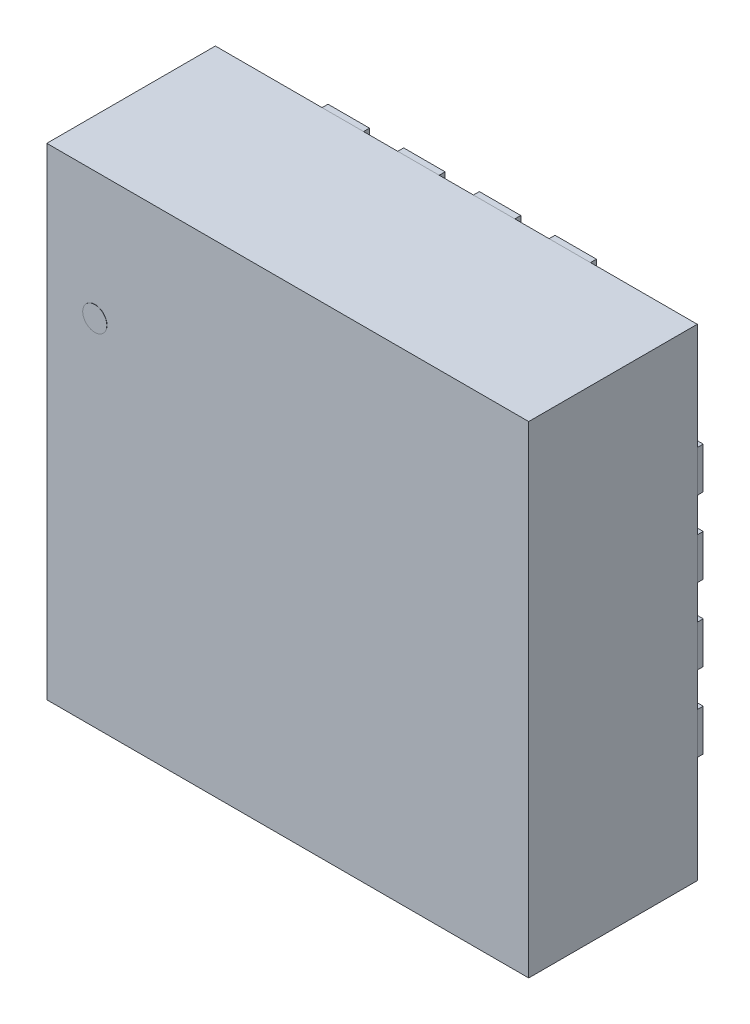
ISO-10303-21;
HEADER;
FILE_DESCRIPTION(('STEP AP214'),'2;1');
FILE_NAME('part.step','',(''),(''),'','','');
FILE_SCHEMA(('AUTOMOTIVE_DESIGN { 1 0 10303 214 1 1 1 1 }'));
ENDSEC;
DATA;
#1=APPLICATION_CONTEXT('core data for automotive mechanical design processes');
#2=APPLICATION_PROTOCOL_DEFINITION('international standard','automotive_design',2000,#1);
#3=PRODUCT_CONTEXT('',#1,'mechanical');
#4=PRODUCT('Part','Part','',(#3));
#5=PRODUCT_RELATED_PRODUCT_CATEGORY('part','',(#4));
#6=PRODUCT_DEFINITION_FORMATION('','',#4);
#7=PRODUCT_DEFINITION_CONTEXT('part definition',#1,'design');
#8=PRODUCT_DEFINITION('design','',#6,#7);
#9=PRODUCT_DEFINITION_SHAPE('','',#8);
#10=(LENGTH_UNIT() NAMED_UNIT(*) SI_UNIT(.MILLI.,.METRE.));
#11=(NAMED_UNIT(*) PLANE_ANGLE_UNIT() SI_UNIT($,.RADIAN.));
#12=(NAMED_UNIT(*) SI_UNIT($,.STERADIAN.) SOLID_ANGLE_UNIT());
#13=UNCERTAINTY_MEASURE_WITH_UNIT(LENGTH_MEASURE(1.E-05),#10,'distance_accuracy_value','');
#14=(GEOMETRIC_REPRESENTATION_CONTEXT(3) GLOBAL_UNCERTAINTY_ASSIGNED_CONTEXT((#13)) GLOBAL_UNIT_ASSIGNED_CONTEXT((#10,
#11,#12)) REPRESENTATION_CONTEXT('',''));
#15=CARTESIAN_POINT('',(0.,0.,0.));
#16=DIRECTION('',(0.,0.,1.));
#17=DIRECTION('',(1.,0.,0.));
#18=AXIS2_PLACEMENT_3D('',#15,#16,#17);
#19=CARTESIAN_POINT('',(-1.656,0.975,1.501));
#20=DIRECTION('',(0.,0.,1.));
#21=DIRECTION('',(1.,0.,0.));
#22=AXIS2_PLACEMENT_3D('',#19,#20,#21);
#23=PLANE('',#22);
#24=CARTESIAN_POINT('',(-1.656,0.975,1.501));
#25=DIRECTION('',(0.,0.,1.));
#26=DIRECTION('',(1.,0.,0.));
#27=AXIS2_PLACEMENT_3D('',#24,#25,#26);
#28=CIRCLE('',#27,0.103505);
#29=CARTESIAN_POINT('',(-1.76,0.975,1.501));
#30=VERTEX_POINT('',#29);
#31=EDGE_CURVE('P0_E26',#30,#30,#28,.T.);
#32=ORIENTED_EDGE('',*,*,#31,.T.);
#33=EDGE_LOOP('',(#32));
#34=FACE_BOUND('',#33,.T.);
#35=ADVANCED_FACE('P0_F16',(#34),#23,.T.);
#36=CARTESIAN_POINT('',(-1.656,0.975,1.499));
#37=DIRECTION('',(0.,0.,1.));
#38=DIRECTION('',(1.,0.,0.));
#39=AXIS2_PLACEMENT_3D('',#36,#37,#38);
#40=PLANE('',#39);
#41=CARTESIAN_POINT('',(-1.656,0.975,1.499));
#42=DIRECTION('',(0.,0.,-1.));
#43=DIRECTION('',(1.,0.,0.));
#44=AXIS2_PLACEMENT_3D('',#41,#42,#43);
#45=CIRCLE('',#44,0.103505);
#46=CARTESIAN_POINT('',(-1.76,0.975,1.499));
#47=VERTEX_POINT('',#46);
#48=EDGE_CURVE('P0_E10',#47,#47,#45,.T.);
#49=ORIENTED_EDGE('',*,*,#48,.T.);
#50=EDGE_LOOP('',(#49));
#51=FACE_BOUND('',#50,.T.);
#52=ADVANCED_FACE('P0_F55',(#51),#40,.F.);
#53=CARTESIAN_POINT('',(-1.656,0.975,1.499));
#54=DIRECTION('',(0.,0.,1.));
#55=DIRECTION('',(1.,0.,0.));
#56=AXIS2_PLACEMENT_3D('',#53,#54,#55);
#57=CYLINDRICAL_SURFACE('',#56,0.103505);
#58=ORIENTED_EDGE('',*,*,#48,.F.);
#59=EDGE_LOOP('',(#58));
#60=FACE_BOUND('',#59,.T.);
#61=ORIENTED_EDGE('',*,*,#31,.F.);
#62=EDGE_LOOP('',(#61));
#63=FACE_BOUND('',#62,.T.);
#64=ADVANCED_FACE('P0_F49',(#60,#63),#57,.T.);
#65=CLOSED_SHELL('',(#35,#52,#64));
#66=MANIFOLD_SOLID_BREP('P0_B1',#65);
#67=CARTESIAN_POINT('',(-2.07,-2.07,1.499));
#68=DIRECTION('',(0.,0.,1.));
#69=DIRECTION('',(1.,0.,0.));
#70=AXIS2_PLACEMENT_3D('',#67,#68,#69);
#71=PLANE('',#70);
#72=DIRECTION('',(1.,0.,0.));
#73=VECTOR('',#72,1.);
#74=CARTESIAN_POINT('',(-2.07,-2.07,1.499));
#75=LINE('',#74,#73);
#76=CARTESIAN_POINT('',(-2.07,-2.07,1.499));
#77=VERTEX_POINT('',#76);
#78=CARTESIAN_POINT('',(2.07,-2.07,1.499));
#79=VERTEX_POINT('',#78);
#80=EDGE_CURVE('P1_E92',#77,#79,#75,.T.);
#81=ORIENTED_EDGE('',*,*,#80,.T.);
#82=DIRECTION('',(0.,1.,0.));
#83=VECTOR('',#82,1.);
#84=CARTESIAN_POINT('',(2.07,-2.07,1.499));
#85=LINE('',#84,#83);
#86=CARTESIAN_POINT('',(2.07,2.07,1.499));
#87=VERTEX_POINT('',#86);
#88=EDGE_CURVE('P1_E65',#79,#87,#85,.T.);
#89=ORIENTED_EDGE('',*,*,#88,.T.);
#90=DIRECTION('',(-1.,0.,0.));
#91=VECTOR('',#90,1.);
#92=CARTESIAN_POINT('',(2.07,2.07,1.499));
#93=LINE('',#92,#91);
#94=CARTESIAN_POINT('',(-2.07,2.07,1.499));
#95=VERTEX_POINT('',#94);
#96=EDGE_CURVE('P1_E103',#87,#95,#93,.T.);
#97=ORIENTED_EDGE('',*,*,#96,.T.);
#98=DIRECTION('',(0.,-1.,0.));
#99=VECTOR('',#98,1.);
#100=CARTESIAN_POINT('',(-2.07,2.07,1.499));
#101=LINE('',#100,#99);
#102=EDGE_CURVE('P1_E11',#95,#77,#101,.T.);
#103=ORIENTED_EDGE('',*,*,#102,.T.);
#104=EDGE_LOOP('',(#81,#89,#97,#103));
#105=FACE_BOUND('',#104,.T.);
#106=ADVANCED_FACE('P1_F17',(#105),#71,.T.);
#107=CARTESIAN_POINT('',(-2.07,2.07,0.051));
#108=DIRECTION('',(0.,0.,-1.));
#109=DIRECTION('',(0.,-1.,0.));
#110=AXIS2_PLACEMENT_3D('',#107,#108,#109);
#111=PLANE('',#110);
#112=DIRECTION('',(1.,0.,0.));
#113=VECTOR('',#112,1.);
#114=CARTESIAN_POINT('',(-2.07,2.07,0.051));
#115=LINE('',#114,#113);
#116=CARTESIAN_POINT('',(-2.07,2.07,0.051));
#117=VERTEX_POINT('',#116);
#118=CARTESIAN_POINT('',(2.07,2.07,0.051));
#119=VERTEX_POINT('',#118);
#120=EDGE_CURVE('P1_E81',#117,#119,#115,.T.);
#121=ORIENTED_EDGE('',*,*,#120,.T.);
#122=DIRECTION('',(0.,-1.,0.));
#123=VECTOR('',#122,1.);
#124=CARTESIAN_POINT('',(2.07,2.07,0.051));
#125=LINE('',#124,#123);
#126=CARTESIAN_POINT('',(2.07,-2.07,0.051));
#127=VERTEX_POINT('',#126);
#128=EDGE_CURVE('P1_E76',#119,#127,#125,.T.);
#129=ORIENTED_EDGE('',*,*,#128,.T.);
#130=DIRECTION('',(-1.,0.,0.));
#131=VECTOR('',#130,1.);
#132=CARTESIAN_POINT('',(2.07,-2.07,0.051));
#133=LINE('',#132,#131);
#134=CARTESIAN_POINT('',(-2.07,-2.07,0.051));
#135=VERTEX_POINT('',#134);
#136=EDGE_CURVE('P1_E79',#127,#135,#133,.T.);
#137=ORIENTED_EDGE('',*,*,#136,.T.);
#138=DIRECTION('',(0.,1.,0.));
#139=VECTOR('',#138,1.);
#140=CARTESIAN_POINT('',(-2.07,-2.07,0.051));
#141=LINE('',#140,#139);
#142=EDGE_CURVE('P1_E28',#135,#117,#141,.T.);
#143=ORIENTED_EDGE('',*,*,#142,.T.);
#144=EDGE_LOOP('',(#121,#129,#137,#143));
#145=FACE_BOUND('',#144,.T.);
#146=ADVANCED_FACE('P1_F77',(#145),#111,.T.);
#147=CARTESIAN_POINT('',(-2.07,2.07,0.051));
#148=DIRECTION('',(-1.,0.,0.));
#149=DIRECTION('',(0.,0.,1.));
#150=AXIS2_PLACEMENT_3D('',#147,#148,#149);
#151=PLANE('',#150);
#152=ORIENTED_EDGE('',*,*,#142,.F.);
#153=DIRECTION('',(0.,0.,1.));
#154=VECTOR('',#153,1.);
#155=CARTESIAN_POINT('',(-2.07,-2.07,0.051));
#156=LINE('',#155,#154);
#157=EDGE_CURVE('P1_E85',#135,#77,#156,.T.);
#158=ORIENTED_EDGE('',*,*,#157,.T.);
#159=ORIENTED_EDGE('',*,*,#102,.F.);
#160=DIRECTION('',(0.,0.,-1.));
#161=VECTOR('',#160,1.);
#162=CARTESIAN_POINT('',(-2.07,2.07,1.499));
#163=LINE('',#162,#161);
#164=EDGE_CURVE('P1_E99',#95,#117,#163,.T.);
#165=ORIENTED_EDGE('',*,*,#164,.T.);
#166=EDGE_LOOP('',(#152,#158,#159,#165));
#167=FACE_BOUND('',#166,.T.);
#168=ADVANCED_FACE('P1_F119',(#167),#151,.T.);
#169=CARTESIAN_POINT('',(2.07,2.07,0.051));
#170=DIRECTION('',(0.,1.,0.));
#171=DIRECTION('',(1.,0.,0.));
#172=AXIS2_PLACEMENT_3D('',#169,#170,#171);
#173=PLANE('',#172);
#174=ORIENTED_EDGE('',*,*,#120,.F.);
#175=ORIENTED_EDGE('',*,*,#164,.F.);
#176=ORIENTED_EDGE('',*,*,#96,.F.);
#177=DIRECTION('',(0.,0.,-1.));
#178=VECTOR('',#177,1.);
#179=CARTESIAN_POINT('',(2.07,2.07,1.499));
#180=LINE('',#179,#178);
#181=EDGE_CURVE('P1_E84',#87,#119,#180,.T.);
#182=ORIENTED_EDGE('',*,*,#181,.T.);
#183=EDGE_LOOP('',(#174,#175,#176,#182));
#184=FACE_BOUND('',#183,.T.);
#185=ADVANCED_FACE('P1_F19',(#184),#173,.T.);
#186=CARTESIAN_POINT('',(2.07,-2.07,0.051));
#187=DIRECTION('',(1.,0.,0.));
#188=DIRECTION('',(0.,1.,0.));
#189=AXIS2_PLACEMENT_3D('',#186,#187,#188);
#190=PLANE('',#189);
#191=ORIENTED_EDGE('',*,*,#128,.F.);
#192=ORIENTED_EDGE('',*,*,#181,.F.);
#193=ORIENTED_EDGE('',*,*,#88,.F.);
#194=DIRECTION('',(0.,0.,-1.));
#195=VECTOR('',#194,1.);
#196=CARTESIAN_POINT('',(2.07,-2.07,1.499));
#197=LINE('',#196,#195);
#198=EDGE_CURVE('P1_E21',#79,#127,#197,.T.);
#199=ORIENTED_EDGE('',*,*,#198,.T.);
#200=EDGE_LOOP('',(#191,#192,#193,#199));
#201=FACE_BOUND('',#200,.T.);
#202=ADVANCED_FACE('P1_F88',(#201),#190,.T.);
#203=CARTESIAN_POINT('',(-2.07,-2.07,0.051));
#204=DIRECTION('',(0.,-1.,0.));
#205=DIRECTION('',(0.,0.,-1.));
#206=AXIS2_PLACEMENT_3D('',#203,#204,#205);
#207=PLANE('',#206);
#208=ORIENTED_EDGE('',*,*,#136,.F.);
#209=ORIENTED_EDGE('',*,*,#198,.F.);
#210=ORIENTED_EDGE('',*,*,#80,.F.);
#211=ORIENTED_EDGE('',*,*,#157,.F.);
#212=EDGE_LOOP('',(#208,#209,#210,#211));
#213=FACE_BOUND('',#212,.T.);
#214=ADVANCED_FACE('P1_F94',(#213),#207,.T.);
#215=CLOSED_SHELL('',(#106,#146,#168,#185,#202,#214));
#216=MANIFOLD_SOLID_BREP('P1_B1',#215);
#217=CARTESIAN_POINT('',(-2.07,0.797,0.051));
#218=DIRECTION('',(0.,0.,1.));
#219=DIRECTION('',(1.,0.,0.));
#220=AXIS2_PLACEMENT_3D('',#217,#218,#219);
#221=PLANE('',#220);
#222=DIRECTION('',(1.,0.,0.));
#223=VECTOR('',#222,1.);
#224=CARTESIAN_POINT('',(-2.07,0.797,0.051));
#225=LINE('',#224,#223);
#226=CARTESIAN_POINT('',(-2.07,0.797,0.051));
#227=VERTEX_POINT('',#226);
#228=CARTESIAN_POINT('',(-1.511,0.797,0.051));
#229=VERTEX_POINT('',#228);
#230=EDGE_CURVE('P2_E73',#227,#229,#225,.T.);
#231=ORIENTED_EDGE('',*,*,#230,.T.);
#232=DIRECTION('',(0.,1.,0.));
#233=VECTOR('',#232,1.);
#234=CARTESIAN_POINT('',(-1.511,0.797,0.051));
#235=LINE('',#234,#233);
#236=CARTESIAN_POINT('',(-1.511,1.153,0.051));
#237=VERTEX_POINT('',#236);
#238=EDGE_CURVE('P2_E21',#229,#237,#235,.T.);
#239=ORIENTED_EDGE('',*,*,#238,.T.);
#240=DIRECTION('',(-1.,0.,0.));
#241=VECTOR('',#240,1.);
#242=CARTESIAN_POINT('',(-1.511,1.153,0.051));
#243=LINE('',#242,#241);
#244=CARTESIAN_POINT('',(-2.07,1.153,0.051));
#245=VERTEX_POINT('',#244);
#246=EDGE_CURVE('P2_E75',#237,#245,#243,.T.);
#247=ORIENTED_EDGE('',*,*,#246,.T.);
#248=DIRECTION('',(0.,-1.,0.));
#249=VECTOR('',#248,1.);
#250=CARTESIAN_POINT('',(-2.07,1.153,0.051));
#251=LINE('',#250,#249);
#252=EDGE_CURVE('P2_E11',#245,#227,#251,.T.);
#253=ORIENTED_EDGE('',*,*,#252,.T.);
#254=EDGE_LOOP('',(#231,#239,#247,#253));
#255=FACE_BOUND('',#254,.T.);
#256=ADVANCED_FACE('P2_F17',(#255),#221,.T.);
#257=CARTESIAN_POINT('',(-2.07,1.153,0.));
#258=DIRECTION('',(0.,0.,-1.));
#259=DIRECTION('',(0.,-1.,0.));
#260=AXIS2_PLACEMENT_3D('',#257,#258,#259);
#261=PLANE('',#260);
#262=DIRECTION('',(1.,0.,0.));
#263=VECTOR('',#262,1.);
#264=CARTESIAN_POINT('',(-2.07,1.153,0.));
#265=LINE('',#264,#263);
#266=CARTESIAN_POINT('',(-2.07,1.153,0.));
#267=VERTEX_POINT('',#266);
#268=CARTESIAN_POINT('',(-1.511,1.153,0.));
#269=VERTEX_POINT('',#268);
#270=EDGE_CURVE('P2_E63',#267,#269,#265,.T.);
#271=ORIENTED_EDGE('',*,*,#270,.T.);
#272=DIRECTION('',(0.,-1.,0.));
#273=VECTOR('',#272,1.);
#274=CARTESIAN_POINT('',(-1.511,1.153,0.));
#275=LINE('',#274,#273);
#276=CARTESIAN_POINT('',(-1.511,0.797,0.));
#277=VERTEX_POINT('',#276);
#278=EDGE_CURVE('P2_E85',#269,#277,#275,.T.);
#279=ORIENTED_EDGE('',*,*,#278,.T.);
#280=DIRECTION('',(-1.,0.,0.));
#281=VECTOR('',#280,1.);
#282=CARTESIAN_POINT('',(-1.511,0.797,0.));
#283=LINE('',#282,#281);
#284=CARTESIAN_POINT('',(-2.07,0.797,0.));
#285=VERTEX_POINT('',#284);
#286=EDGE_CURVE('P2_E95',#277,#285,#283,.T.);
#287=ORIENTED_EDGE('',*,*,#286,.T.);
#288=DIRECTION('',(0.,1.,0.));
#289=VECTOR('',#288,1.);
#290=CARTESIAN_POINT('',(-2.07,0.797,0.));
#291=LINE('',#290,#289);
#292=EDGE_CURVE('P2_E28',#285,#267,#291,.T.);
#293=ORIENTED_EDGE('',*,*,#292,.T.);
#294=EDGE_LOOP('',(#271,#279,#287,#293));
#295=FACE_BOUND('',#294,.T.);
#296=ADVANCED_FACE('P2_F119',(#295),#261,.T.);
#297=CARTESIAN_POINT('',(-2.07,1.153,0.));
#298=DIRECTION('',(-1.,0.,0.));
#299=DIRECTION('',(0.,0.,1.));
#300=AXIS2_PLACEMENT_3D('',#297,#298,#299);
#301=PLANE('',#300);
#302=ORIENTED_EDGE('',*,*,#292,.F.);
#303=DIRECTION('',(0.,0.,1.));
#304=VECTOR('',#303,1.);
#305=CARTESIAN_POINT('',(-2.07,0.797,0.));
#306=LINE('',#305,#304);
#307=EDGE_CURVE('P2_E79',#285,#227,#306,.T.);
#308=ORIENTED_EDGE('',*,*,#307,.T.);
#309=ORIENTED_EDGE('',*,*,#252,.F.);
#310=DIRECTION('',(0.,0.,-1.));
#311=VECTOR('',#310,1.);
#312=CARTESIAN_POINT('',(-2.07,1.153,0.051));
#313=LINE('',#312,#311);
#314=EDGE_CURVE('P2_E102',#245,#267,#313,.T.);
#315=ORIENTED_EDGE('',*,*,#314,.T.);
#316=EDGE_LOOP('',(#302,#308,#309,#315));
#317=FACE_BOUND('',#316,.T.);
#318=ADVANCED_FACE('P2_F80',(#317),#301,.T.);
#319=CARTESIAN_POINT('',(-1.511,1.153,0.));
#320=DIRECTION('',(0.,1.,0.));
#321=DIRECTION('',(1.,0.,0.));
#322=AXIS2_PLACEMENT_3D('',#319,#320,#321);
#323=PLANE('',#322);
#324=ORIENTED_EDGE('',*,*,#270,.F.);
#325=ORIENTED_EDGE('',*,*,#314,.F.);
#326=ORIENTED_EDGE('',*,*,#246,.F.);
#327=DIRECTION('',(0.,0.,-1.));
#328=VECTOR('',#327,1.);
#329=CARTESIAN_POINT('',(-1.511,1.153,0.051));
#330=LINE('',#329,#328);
#331=EDGE_CURVE('P2_E99',#237,#269,#330,.T.);
#332=ORIENTED_EDGE('',*,*,#331,.T.);
#333=EDGE_LOOP('',(#324,#325,#326,#332));
#334=FACE_BOUND('',#333,.T.);
#335=ADVANCED_FACE('P2_F155',(#334),#323,.T.);
#336=CARTESIAN_POINT('',(-1.511,0.797,0.));
#337=DIRECTION('',(1.,0.,0.));
#338=DIRECTION('',(0.,1.,0.));
#339=AXIS2_PLACEMENT_3D('',#336,#337,#338);
#340=PLANE('',#339);
#341=ORIENTED_EDGE('',*,*,#278,.F.);
#342=ORIENTED_EDGE('',*,*,#331,.F.);
#343=ORIENTED_EDGE('',*,*,#238,.F.);
#344=DIRECTION('',(0.,0.,-1.));
#345=VECTOR('',#344,1.);
#346=CARTESIAN_POINT('',(-1.511,0.797,0.051));
#347=LINE('',#346,#345);
#348=EDGE_CURVE('P2_E89',#229,#277,#347,.T.);
#349=ORIENTED_EDGE('',*,*,#348,.T.);
#350=EDGE_LOOP('',(#341,#342,#343,#349));
#351=FACE_BOUND('',#350,.T.);
#352=ADVANCED_FACE('P2_F19',(#351),#340,.T.);
#353=CARTESIAN_POINT('',(-2.07,0.797,0.));
#354=DIRECTION('',(0.,-1.,0.));
#355=DIRECTION('',(0.,0.,-1.));
#356=AXIS2_PLACEMENT_3D('',#353,#354,#355);
#357=PLANE('',#356);
#358=ORIENTED_EDGE('',*,*,#286,.F.);
#359=ORIENTED_EDGE('',*,*,#348,.F.);
#360=ORIENTED_EDGE('',*,*,#230,.F.);
#361=ORIENTED_EDGE('',*,*,#307,.F.);
#362=EDGE_LOOP('',(#358,#359,#360,#361));
#363=FACE_BOUND('',#362,.T.);
#364=ADVANCED_FACE('P2_F87',(#363),#357,.T.);
#365=CLOSED_SHELL('',(#256,#296,#318,#335,#352,#364));
#366=MANIFOLD_SOLID_BREP('P2_B1',#365);
#367=CARTESIAN_POINT('',(-2.07,0.147,0.051));
#368=DIRECTION('',(0.,0.,1.));
#369=DIRECTION('',(1.,0.,0.));
#370=AXIS2_PLACEMENT_3D('',#367,#368,#369);
#371=PLANE('',#370);
#372=DIRECTION('',(1.,0.,0.));
#373=VECTOR('',#372,1.);
#374=CARTESIAN_POINT('',(-2.07,0.147,0.051));
#375=LINE('',#374,#373);
#376=CARTESIAN_POINT('',(-2.07,0.147,0.051));
#377=VERTEX_POINT('',#376);
#378=CARTESIAN_POINT('',(-1.511,0.147,0.051));
#379=VERTEX_POINT('',#378);
#380=EDGE_CURVE('P3_E75',#377,#379,#375,.T.);
#381=ORIENTED_EDGE('',*,*,#380,.T.);
#382=DIRECTION('',(0.,1.,0.));
#383=VECTOR('',#382,1.);
#384=CARTESIAN_POINT('',(-1.511,0.147,0.051));
#385=LINE('',#384,#383);
#386=CARTESIAN_POINT('',(-1.511,0.503,0.051));
#387=VERTEX_POINT('',#386);
#388=EDGE_CURVE('P3_E69',#379,#387,#385,.T.);
#389=ORIENTED_EDGE('',*,*,#388,.T.);
#390=DIRECTION('',(-1.,0.,0.));
#391=VECTOR('',#390,1.);
#392=CARTESIAN_POINT('',(-1.511,0.503,0.051));
#393=LINE('',#392,#391);
#394=CARTESIAN_POINT('',(-2.07,0.503,0.051));
#395=VERTEX_POINT('',#394);
#396=EDGE_CURVE('P3_E77',#387,#395,#393,.T.);
#397=ORIENTED_EDGE('',*,*,#396,.T.);
#398=DIRECTION('',(0.,-1.,0.));
#399=VECTOR('',#398,1.);
#400=CARTESIAN_POINT('',(-2.07,0.503,0.051));
#401=LINE('',#400,#399);
#402=EDGE_CURVE('P3_E11',#395,#377,#401,.T.);
#403=ORIENTED_EDGE('',*,*,#402,.T.);
#404=EDGE_LOOP('',(#381,#389,#397,#403));
#405=FACE_BOUND('',#404,.T.);
#406=ADVANCED_FACE('P3_F17',(#405),#371,.T.);
#407=CARTESIAN_POINT('',(-2.07,0.503,0.));
#408=DIRECTION('',(0.,0.,-1.));
#409=DIRECTION('',(0.,-1.,0.));
#410=AXIS2_PLACEMENT_3D('',#407,#408,#409);
#411=PLANE('',#410);
#412=DIRECTION('',(1.,0.,0.));
#413=VECTOR('',#412,1.);
#414=CARTESIAN_POINT('',(-2.07,0.503,0.));
#415=LINE('',#414,#413);
#416=CARTESIAN_POINT('',(-2.07,0.503,0.));
#417=VERTEX_POINT('',#416);
#418=CARTESIAN_POINT('',(-1.511,0.503,0.));
#419=VERTEX_POINT('',#418);
#420=EDGE_CURVE('P3_E104',#417,#419,#415,.T.);
#421=ORIENTED_EDGE('',*,*,#420,.T.);
#422=DIRECTION('',(0.,-1.,0.));
#423=VECTOR('',#422,1.);
#424=CARTESIAN_POINT('',(-1.511,0.503,0.));
#425=LINE('',#424,#423);
#426=CARTESIAN_POINT('',(-1.511,0.147,0.));
#427=VERTEX_POINT('',#426);
#428=EDGE_CURVE('P3_E86',#419,#427,#425,.T.);
#429=ORIENTED_EDGE('',*,*,#428,.T.);
#430=DIRECTION('',(-1.,0.,0.));
#431=VECTOR('',#430,1.);
#432=CARTESIAN_POINT('',(-1.511,0.147,0.));
#433=LINE('',#432,#431);
#434=CARTESIAN_POINT('',(-2.07,0.147,0.));
#435=VERTEX_POINT('',#434);
#436=EDGE_CURVE('P3_E21',#427,#435,#433,.T.);
#437=ORIENTED_EDGE('',*,*,#436,.T.);
#438=DIRECTION('',(0.,1.,0.));
#439=VECTOR('',#438,1.);
#440=CARTESIAN_POINT('',(-2.07,0.147,0.));
#441=LINE('',#440,#439);
#442=EDGE_CURVE('P3_E28',#435,#417,#441,.T.);
#443=ORIENTED_EDGE('',*,*,#442,.T.);
#444=EDGE_LOOP('',(#421,#429,#437,#443));
#445=FACE_BOUND('',#444,.T.);
#446=ADVANCED_FACE('P3_F114',(#445),#411,.T.);
#447=CARTESIAN_POINT('',(-2.07,0.503,0.));
#448=DIRECTION('',(-1.,0.,0.));
#449=DIRECTION('',(0.,0.,1.));
#450=AXIS2_PLACEMENT_3D('',#447,#448,#449);
#451=PLANE('',#450);
#452=ORIENTED_EDGE('',*,*,#442,.F.);
#453=DIRECTION('',(0.,0.,1.));
#454=VECTOR('',#453,1.);
#455=CARTESIAN_POINT('',(-2.07,0.147,0.));
#456=LINE('',#455,#454);
#457=EDGE_CURVE('P3_E80',#435,#377,#456,.T.);
#458=ORIENTED_EDGE('',*,*,#457,.T.);
#459=ORIENTED_EDGE('',*,*,#402,.F.);
#460=DIRECTION('',(0.,0.,-1.));
#461=VECTOR('',#460,1.);
#462=CARTESIAN_POINT('',(-2.07,0.503,0.051));
#463=LINE('',#462,#461);
#464=EDGE_CURVE('P3_E97',#395,#417,#463,.T.);
#465=ORIENTED_EDGE('',*,*,#464,.T.);
#466=EDGE_LOOP('',(#452,#458,#459,#465));
#467=FACE_BOUND('',#466,.T.);
#468=ADVANCED_FACE('P3_F81',(#467),#451,.T.);
#469=CARTESIAN_POINT('',(-1.511,0.503,0.));
#470=DIRECTION('',(0.,1.,0.));
#471=DIRECTION('',(1.,0.,0.));
#472=AXIS2_PLACEMENT_3D('',#469,#470,#471);
#473=PLANE('',#472);
#474=ORIENTED_EDGE('',*,*,#420,.F.);
#475=ORIENTED_EDGE('',*,*,#464,.F.);
#476=ORIENTED_EDGE('',*,*,#396,.F.);
#477=DIRECTION('',(0.,0.,-1.));
#478=VECTOR('',#477,1.);
#479=CARTESIAN_POINT('',(-1.511,0.503,0.051));
#480=LINE('',#479,#478);
#481=EDGE_CURVE('P3_E98',#387,#419,#480,.T.);
#482=ORIENTED_EDGE('',*,*,#481,.T.);
#483=EDGE_LOOP('',(#474,#475,#476,#482));
#484=FACE_BOUND('',#483,.T.);
#485=ADVANCED_FACE('P3_F117',(#484),#473,.T.);
#486=CARTESIAN_POINT('',(-1.511,0.147,0.));
#487=DIRECTION('',(1.,0.,0.));
#488=DIRECTION('',(0.,1.,0.));
#489=AXIS2_PLACEMENT_3D('',#486,#487,#488);
#490=PLANE('',#489);
#491=ORIENTED_EDGE('',*,*,#428,.F.);
#492=ORIENTED_EDGE('',*,*,#481,.F.);
#493=ORIENTED_EDGE('',*,*,#388,.F.);
#494=DIRECTION('',(0.,0.,-1.));
#495=VECTOR('',#494,1.);
#496=CARTESIAN_POINT('',(-1.511,0.147,0.051));
#497=LINE('',#496,#495);
#498=EDGE_CURVE('P3_E88',#379,#427,#497,.T.);
#499=ORIENTED_EDGE('',*,*,#498,.T.);
#500=EDGE_LOOP('',(#491,#492,#493,#499));
#501=FACE_BOUND('',#500,.T.);
#502=ADVANCED_FACE('P3_F119',(#501),#490,.T.);
#503=CARTESIAN_POINT('',(-2.07,0.147,0.));
#504=DIRECTION('',(0.,-1.,0.));
#505=DIRECTION('',(0.,0.,-1.));
#506=AXIS2_PLACEMENT_3D('',#503,#504,#505);
#507=PLANE('',#506);
#508=ORIENTED_EDGE('',*,*,#436,.F.);
#509=ORIENTED_EDGE('',*,*,#498,.F.);
#510=ORIENTED_EDGE('',*,*,#380,.F.);
#511=ORIENTED_EDGE('',*,*,#457,.F.);
#512=EDGE_LOOP('',(#508,#509,#510,#511));
#513=FACE_BOUND('',#512,.T.);
#514=ADVANCED_FACE('P3_F19',(#513),#507,.T.);
#515=CLOSED_SHELL('',(#406,#446,#468,#485,#502,#514));
#516=MANIFOLD_SOLID_BREP('P3_B1',#515);
#517=CARTESIAN_POINT('',(-2.07,-0.503,0.051));
#518=DIRECTION('',(0.,0.,1.));
#519=DIRECTION('',(1.,0.,0.));
#520=AXIS2_PLACEMENT_3D('',#517,#518,#519);
#521=PLANE('',#520);
#522=DIRECTION('',(1.,0.,0.));
#523=VECTOR('',#522,1.);
#524=CARTESIAN_POINT('',(-2.07,-0.503,0.051));
#525=LINE('',#524,#523);
#526=CARTESIAN_POINT('',(-2.07,-0.503,0.051));
#527=VERTEX_POINT('',#526);
#528=CARTESIAN_POINT('',(-1.511,-0.503,0.051));
#529=VERTEX_POINT('',#528);
#530=EDGE_CURVE('P4_E79',#527,#529,#525,.T.);
#531=ORIENTED_EDGE('',*,*,#530,.T.);
#532=DIRECTION('',(0.,1.,0.));
#533=VECTOR('',#532,1.);
#534=CARTESIAN_POINT('',(-1.511,-0.503,0.051));
#535=LINE('',#534,#533);
#536=CARTESIAN_POINT('',(-1.511,-0.147,0.051));
#537=VERTEX_POINT('',#536);
#538=EDGE_CURVE('P4_E21',#529,#537,#535,.T.);
#539=ORIENTED_EDGE('',*,*,#538,.T.);
#540=DIRECTION('',(-1.,0.,0.));
#541=VECTOR('',#540,1.);
#542=CARTESIAN_POINT('',(-1.511,-0.147,0.051));
#543=LINE('',#542,#541);
#544=CARTESIAN_POINT('',(-2.07,-0.147,0.051));
#545=VERTEX_POINT('',#544);
#546=EDGE_CURVE('P4_E66',#537,#545,#543,.T.);
#547=ORIENTED_EDGE('',*,*,#546,.T.);
#548=DIRECTION('',(0.,-1.,0.));
#549=VECTOR('',#548,1.);
#550=CARTESIAN_POINT('',(-2.07,-0.147,0.051));
#551=LINE('',#550,#549);
#552=EDGE_CURVE('P4_E11',#545,#527,#551,.T.);
#553=ORIENTED_EDGE('',*,*,#552,.T.);
#554=EDGE_LOOP('',(#531,#539,#547,#553));
#555=FACE_BOUND('',#554,.T.);
#556=ADVANCED_FACE('P4_F17',(#555),#521,.T.);
#557=CARTESIAN_POINT('',(-2.07,-0.147,0.));
#558=DIRECTION('',(0.,0.,-1.));
#559=DIRECTION('',(0.,-1.,0.));
#560=AXIS2_PLACEMENT_3D('',#557,#558,#559);
#561=PLANE('',#560);
#562=DIRECTION('',(1.,0.,0.));
#563=VECTOR('',#562,1.);
#564=CARTESIAN_POINT('',(-2.07,-0.147,0.));
#565=LINE('',#564,#563);
#566=CARTESIAN_POINT('',(-2.07,-0.147,0.));
#567=VERTEX_POINT('',#566);
#568=CARTESIAN_POINT('',(-1.511,-0.147,0.));
#569=VERTEX_POINT('',#568);
#570=EDGE_CURVE('P4_E84',#567,#569,#565,.T.);
#571=ORIENTED_EDGE('',*,*,#570,.T.);
#572=DIRECTION('',(0.,-1.,0.));
#573=VECTOR('',#572,1.);
#574=CARTESIAN_POINT('',(-1.511,-0.147,0.));
#575=LINE('',#574,#573);
#576=CARTESIAN_POINT('',(-1.511,-0.503,0.));
#577=VERTEX_POINT('',#576);
#578=EDGE_CURVE('P4_E87',#569,#577,#575,.T.);
#579=ORIENTED_EDGE('',*,*,#578,.T.);
#580=DIRECTION('',(-1.,0.,0.));
#581=VECTOR('',#580,1.);
#582=CARTESIAN_POINT('',(-1.511,-0.503,0.));
#583=LINE('',#582,#581);
#584=CARTESIAN_POINT('',(-2.07,-0.503,0.));
#585=VERTEX_POINT('',#584);
#586=EDGE_CURVE('P4_E103',#577,#585,#583,.T.);
#587=ORIENTED_EDGE('',*,*,#586,.T.);
#588=DIRECTION('',(0.,1.,0.));
#589=VECTOR('',#588,1.);
#590=CARTESIAN_POINT('',(-2.07,-0.503,0.));
#591=LINE('',#590,#589);
#592=EDGE_CURVE('P4_E28',#585,#567,#591,.T.);
#593=ORIENTED_EDGE('',*,*,#592,.T.);
#594=EDGE_LOOP('',(#571,#579,#587,#593));
#595=FACE_BOUND('',#594,.T.);
#596=ADVANCED_FACE('P4_F19',(#595),#561,.T.);
#597=CARTESIAN_POINT('',(-2.07,-0.147,0.));
#598=DIRECTION('',(-1.,0.,0.));
#599=DIRECTION('',(0.,0.,1.));
#600=AXIS2_PLACEMENT_3D('',#597,#598,#599);
#601=PLANE('',#600);
#602=ORIENTED_EDGE('',*,*,#592,.F.);
#603=DIRECTION('',(0.,0.,1.));
#604=VECTOR('',#603,1.);
#605=CARTESIAN_POINT('',(-2.07,-0.503,0.));
#606=LINE('',#605,#604);
#607=EDGE_CURVE('P4_E93',#585,#527,#606,.T.);
#608=ORIENTED_EDGE('',*,*,#607,.T.);
#609=ORIENTED_EDGE('',*,*,#552,.F.);
#610=DIRECTION('',(0.,0.,-1.));
#611=VECTOR('',#610,1.);
#612=CARTESIAN_POINT('',(-2.07,-0.147,0.051));
#613=LINE('',#612,#611);
#614=EDGE_CURVE('P4_E73',#545,#567,#613,.T.);
#615=ORIENTED_EDGE('',*,*,#614,.T.);
#616=EDGE_LOOP('',(#602,#608,#609,#615));
#617=FACE_BOUND('',#616,.T.);
#618=ADVANCED_FACE('P4_F114',(#617),#601,.T.);
#619=CARTESIAN_POINT('',(-1.511,-0.147,0.));
#620=DIRECTION('',(0.,1.,0.));
#621=DIRECTION('',(1.,0.,0.));
#622=AXIS2_PLACEMENT_3D('',#619,#620,#621);
#623=PLANE('',#622);
#624=ORIENTED_EDGE('',*,*,#570,.F.);
#625=ORIENTED_EDGE('',*,*,#614,.F.);
#626=ORIENTED_EDGE('',*,*,#546,.F.);
#627=DIRECTION('',(0.,0.,-1.));
#628=VECTOR('',#627,1.);
#629=CARTESIAN_POINT('',(-1.511,-0.147,0.051));
#630=LINE('',#629,#628);
#631=EDGE_CURVE('P4_E71',#537,#569,#630,.T.);
#632=ORIENTED_EDGE('',*,*,#631,.T.);
#633=EDGE_LOOP('',(#624,#625,#626,#632));
#634=FACE_BOUND('',#633,.T.);
#635=ADVANCED_FACE('P4_F69',(#634),#623,.T.);
#636=CARTESIAN_POINT('',(-1.511,-0.503,0.));
#637=DIRECTION('',(1.,0.,0.));
#638=DIRECTION('',(0.,1.,0.));
#639=AXIS2_PLACEMENT_3D('',#636,#637,#638);
#640=PLANE('',#639);
#641=ORIENTED_EDGE('',*,*,#578,.F.);
#642=ORIENTED_EDGE('',*,*,#631,.F.);
#643=ORIENTED_EDGE('',*,*,#538,.F.);
#644=DIRECTION('',(0.,0.,-1.));
#645=VECTOR('',#644,1.);
#646=CARTESIAN_POINT('',(-1.511,-0.503,0.051));
#647=LINE('',#646,#645);
#648=EDGE_CURVE('P4_E100',#529,#577,#647,.T.);
#649=ORIENTED_EDGE('',*,*,#648,.T.);
#650=EDGE_LOOP('',(#641,#642,#643,#649));
#651=FACE_BOUND('',#650,.T.);
#652=ADVANCED_FACE('P4_F85',(#651),#640,.T.);
#653=CARTESIAN_POINT('',(-2.07,-0.503,0.));
#654=DIRECTION('',(0.,-1.,0.));
#655=DIRECTION('',(0.,0.,-1.));
#656=AXIS2_PLACEMENT_3D('',#653,#654,#655);
#657=PLANE('',#656);
#658=ORIENTED_EDGE('',*,*,#586,.F.);
#659=ORIENTED_EDGE('',*,*,#648,.F.);
#660=ORIENTED_EDGE('',*,*,#530,.F.);
#661=ORIENTED_EDGE('',*,*,#607,.F.);
#662=EDGE_LOOP('',(#658,#659,#660,#661));
#663=FACE_BOUND('',#662,.T.);
#664=ADVANCED_FACE('P4_F118',(#663),#657,.T.);
#665=CLOSED_SHELL('',(#556,#596,#618,#635,#652,#664));
#666=MANIFOLD_SOLID_BREP('P4_B1',#665);
#667=CARTESIAN_POINT('',(-2.07,-1.153,0.051));
#668=DIRECTION('',(0.,0.,1.));
#669=DIRECTION('',(1.,0.,0.));
#670=AXIS2_PLACEMENT_3D('',#667,#668,#669);
#671=PLANE('',#670);
#672=DIRECTION('',(1.,0.,0.));
#673=VECTOR('',#672,1.);
#674=CARTESIAN_POINT('',(-2.07,-1.153,0.051));
#675=LINE('',#674,#673);
#676=CARTESIAN_POINT('',(-2.07,-1.153,0.051));
#677=VERTEX_POINT('',#676);
#678=CARTESIAN_POINT('',(-1.511,-1.153,0.051));
#679=VERTEX_POINT('',#678);
#680=EDGE_CURVE('P5_E81',#677,#679,#675,.T.);
#681=ORIENTED_EDGE('',*,*,#680,.T.);
#682=DIRECTION('',(0.,1.,0.));
#683=VECTOR('',#682,1.);
#684=CARTESIAN_POINT('',(-1.511,-1.153,0.051));
#685=LINE('',#684,#683);
#686=CARTESIAN_POINT('',(-1.511,-0.797,0.051));
#687=VERTEX_POINT('',#686);
#688=EDGE_CURVE('P5_E67',#679,#687,#685,.T.);
#689=ORIENTED_EDGE('',*,*,#688,.T.);
#690=DIRECTION('',(-1.,0.,0.));
#691=VECTOR('',#690,1.);
#692=CARTESIAN_POINT('',(-1.511,-0.797,0.051));
#693=LINE('',#692,#691);
#694=CARTESIAN_POINT('',(-2.07,-0.797,0.051));
#695=VERTEX_POINT('',#694);
#696=EDGE_CURVE('P5_E95',#687,#695,#693,.T.);
#697=ORIENTED_EDGE('',*,*,#696,.T.);
#698=DIRECTION('',(0.,-1.,0.));
#699=VECTOR('',#698,1.);
#700=CARTESIAN_POINT('',(-2.07,-0.797,0.051));
#701=LINE('',#700,#699);
#702=EDGE_CURVE('P5_E11',#695,#677,#701,.T.);
#703=ORIENTED_EDGE('',*,*,#702,.T.);
#704=EDGE_LOOP('',(#681,#689,#697,#703));
#705=FACE_BOUND('',#704,.T.);
#706=ADVANCED_FACE('P5_F17',(#705),#671,.T.);
#707=CARTESIAN_POINT('',(-2.07,-0.797,0.));
#708=DIRECTION('',(0.,0.,-1.));
#709=DIRECTION('',(0.,-1.,0.));
#710=AXIS2_PLACEMENT_3D('',#707,#708,#709);
#711=PLANE('',#710);
#712=DIRECTION('',(1.,0.,0.));
#713=VECTOR('',#712,1.);
#714=CARTESIAN_POINT('',(-2.07,-0.797,0.));
#715=LINE('',#714,#713);
#716=CARTESIAN_POINT('',(-2.07,-0.797,0.));
#717=VERTEX_POINT('',#716);
#718=CARTESIAN_POINT('',(-1.511,-0.797,0.));
#719=VERTEX_POINT('',#718);
#720=EDGE_CURVE('P5_E78',#717,#719,#715,.T.);
#721=ORIENTED_EDGE('',*,*,#720,.T.);
#722=DIRECTION('',(0.,-1.,0.));
#723=VECTOR('',#722,1.);
#724=CARTESIAN_POINT('',(-1.511,-0.797,0.));
#725=LINE('',#724,#723);
#726=CARTESIAN_POINT('',(-1.511,-1.153,0.));
#727=VERTEX_POINT('',#726);
#728=EDGE_CURVE('P5_E99',#719,#727,#725,.T.);
#729=ORIENTED_EDGE('',*,*,#728,.T.);
#730=DIRECTION('',(-1.,0.,0.));
#731=VECTOR('',#730,1.);
#732=CARTESIAN_POINT('',(-1.511,-1.153,0.));
#733=LINE('',#732,#731);
#734=CARTESIAN_POINT('',(-2.07,-1.153,0.));
#735=VERTEX_POINT('',#734);
#736=EDGE_CURVE('P5_E20',#727,#735,#733,.T.);
#737=ORIENTED_EDGE('',*,*,#736,.T.);
#738=DIRECTION('',(0.,1.,0.));
#739=VECTOR('',#738,1.);
#740=CARTESIAN_POINT('',(-2.07,-1.153,0.));
#741=LINE('',#740,#739);
#742=EDGE_CURVE('P5_E27',#735,#717,#741,.T.);
#743=ORIENTED_EDGE('',*,*,#742,.T.);
#744=EDGE_LOOP('',(#721,#729,#737,#743));
#745=FACE_BOUND('',#744,.T.);
#746=ADVANCED_FACE('P5_F117',(#745),#711,.T.);
#747=CARTESIAN_POINT('',(-2.07,-0.797,0.));
#748=DIRECTION('',(-1.,0.,0.));
#749=DIRECTION('',(0.,0.,1.));
#750=AXIS2_PLACEMENT_3D('',#747,#748,#749);
#751=PLANE('',#750);
#752=ORIENTED_EDGE('',*,*,#742,.F.);
#753=DIRECTION('',(0.,0.,1.));
#754=VECTOR('',#753,1.);
#755=CARTESIAN_POINT('',(-2.07,-1.153,0.));
#756=LINE('',#755,#754);
#757=EDGE_CURVE('P5_E85',#735,#677,#756,.T.);
#758=ORIENTED_EDGE('',*,*,#757,.T.);
#759=ORIENTED_EDGE('',*,*,#702,.F.);
#760=DIRECTION('',(0.,0.,-1.));
#761=VECTOR('',#760,1.);
#762=CARTESIAN_POINT('',(-2.07,-0.797,0.051));
#763=LINE('',#762,#761);
#764=EDGE_CURVE('P5_E96',#695,#717,#763,.T.);
#765=ORIENTED_EDGE('',*,*,#764,.T.);
#766=EDGE_LOOP('',(#752,#758,#759,#765));
#767=FACE_BOUND('',#766,.T.);
#768=ADVANCED_FACE('P5_F115',(#767),#751,.T.);
#769=CARTESIAN_POINT('',(-1.511,-0.797,0.));
#770=DIRECTION('',(0.,1.,0.));
#771=DIRECTION('',(1.,0.,0.));
#772=AXIS2_PLACEMENT_3D('',#769,#770,#771);
#773=PLANE('',#772);
#774=ORIENTED_EDGE('',*,*,#720,.F.);
#775=ORIENTED_EDGE('',*,*,#764,.F.);
#776=ORIENTED_EDGE('',*,*,#696,.F.);
#777=DIRECTION('',(0.,0.,-1.));
#778=VECTOR('',#777,1.);
#779=CARTESIAN_POINT('',(-1.511,-0.797,0.051));
#780=LINE('',#779,#778);
#781=EDGE_CURVE('P5_E75',#687,#719,#780,.T.);
#782=ORIENTED_EDGE('',*,*,#781,.T.);
#783=EDGE_LOOP('',(#774,#775,#776,#782));
#784=FACE_BOUND('',#783,.T.);
#785=ADVANCED_FACE('P5_F114',(#784),#773,.T.);
#786=CARTESIAN_POINT('',(-1.511,-1.153,0.));
#787=DIRECTION('',(1.,0.,0.));
#788=DIRECTION('',(0.,1.,0.));
#789=AXIS2_PLACEMENT_3D('',#786,#787,#788);
#790=PLANE('',#789);
#791=ORIENTED_EDGE('',*,*,#728,.F.);
#792=ORIENTED_EDGE('',*,*,#781,.F.);
#793=ORIENTED_EDGE('',*,*,#688,.F.);
#794=DIRECTION('',(0.,0.,-1.));
#795=VECTOR('',#794,1.);
#796=CARTESIAN_POINT('',(-1.511,-1.153,0.051));
#797=LINE('',#796,#795);
#798=EDGE_CURVE('P5_E72',#679,#727,#797,.T.);
#799=ORIENTED_EDGE('',*,*,#798,.T.);
#800=EDGE_LOOP('',(#791,#792,#793,#799));
#801=FACE_BOUND('',#800,.T.);
#802=ADVANCED_FACE('P5_F70',(#801),#790,.T.);
#803=CARTESIAN_POINT('',(-2.07,-1.153,0.));
#804=DIRECTION('',(0.,-1.,0.));
#805=DIRECTION('',(0.,0.,-1.));
#806=AXIS2_PLACEMENT_3D('',#803,#804,#805);
#807=PLANE('',#806);
#808=ORIENTED_EDGE('',*,*,#736,.F.);
#809=ORIENTED_EDGE('',*,*,#798,.F.);
#810=ORIENTED_EDGE('',*,*,#680,.F.);
#811=ORIENTED_EDGE('',*,*,#757,.F.);
#812=EDGE_LOOP('',(#808,#809,#810,#811));
#813=FACE_BOUND('',#812,.T.);
#814=ADVANCED_FACE('P5_F87',(#813),#807,.T.);
#815=CLOSED_SHELL('',(#706,#746,#768,#785,#802,#814));
#816=MANIFOLD_SOLID_BREP('P5_B1',#815);
#817=CARTESIAN_POINT('',(-1.153,-2.07,0.051));
#818=DIRECTION('',(0.,0.,1.));
#819=DIRECTION('',(1.,0.,0.));
#820=AXIS2_PLACEMENT_3D('',#817,#818,#819);
#821=PLANE('',#820);
#822=DIRECTION('',(1.,0.,0.));
#823=VECTOR('',#822,1.);
#824=CARTESIAN_POINT('',(-1.153,-2.07,0.051));
#825=LINE('',#824,#823);
#826=CARTESIAN_POINT('',(-1.153,-2.07,0.051));
#827=VERTEX_POINT('',#826);
#828=CARTESIAN_POINT('',(-0.797,-2.07,0.051));
#829=VERTEX_POINT('',#828);
#830=EDGE_CURVE('P6_E86',#827,#829,#825,.T.);
#831=ORIENTED_EDGE('',*,*,#830,.T.);
#832=DIRECTION('',(0.,1.,0.));
#833=VECTOR('',#832,1.);
#834=CARTESIAN_POINT('',(-0.797,-2.07,0.051));
#835=LINE('',#834,#833);
#836=CARTESIAN_POINT('',(-0.797,-1.511,0.051));
#837=VERTEX_POINT('',#836);
#838=EDGE_CURVE('P6_E21',#829,#837,#835,.T.);
#839=ORIENTED_EDGE('',*,*,#838,.T.);
#840=DIRECTION('',(-1.,0.,0.));
#841=VECTOR('',#840,1.);
#842=CARTESIAN_POINT('',(-0.797,-1.511,0.051));
#843=LINE('',#842,#841);
#844=CARTESIAN_POINT('',(-1.153,-1.511,0.051));
#845=VERTEX_POINT('',#844);
#846=EDGE_CURVE('P6_E76',#837,#845,#843,.T.);
#847=ORIENTED_EDGE('',*,*,#846,.T.);
#848=DIRECTION('',(0.,-1.,0.));
#849=VECTOR('',#848,1.);
#850=CARTESIAN_POINT('',(-1.153,-1.511,0.051));
#851=LINE('',#850,#849);
#852=EDGE_CURVE('P6_E11',#845,#827,#851,.T.);
#853=ORIENTED_EDGE('',*,*,#852,.T.);
#854=EDGE_LOOP('',(#831,#839,#847,#853));
#855=FACE_BOUND('',#854,.T.);
#856=ADVANCED_FACE('P6_F17',(#855),#821,.T.);
#857=CARTESIAN_POINT('',(-1.153,-1.511,0.));
#858=DIRECTION('',(0.,0.,-1.));
#859=DIRECTION('',(0.,-1.,0.));
#860=AXIS2_PLACEMENT_3D('',#857,#858,#859);
#861=PLANE('',#860);
#862=DIRECTION('',(1.,0.,0.));
#863=VECTOR('',#862,1.);
#864=CARTESIAN_POINT('',(-1.153,-1.511,0.));
#865=LINE('',#864,#863);
#866=CARTESIAN_POINT('',(-1.153,-1.511,0.));
#867=VERTEX_POINT('',#866);
#868=CARTESIAN_POINT('',(-0.797,-1.511,0.));
#869=VERTEX_POINT('',#868);
#870=EDGE_CURVE('P6_E80',#867,#869,#865,.T.);
#871=ORIENTED_EDGE('',*,*,#870,.T.);
#872=DIRECTION('',(0.,-1.,0.));
#873=VECTOR('',#872,1.);
#874=CARTESIAN_POINT('',(-0.797,-1.511,0.));
#875=LINE('',#874,#873);
#876=CARTESIAN_POINT('',(-0.797,-2.07,0.));
#877=VERTEX_POINT('',#876);
#878=EDGE_CURVE('P6_E58',#869,#877,#875,.T.);
#879=ORIENTED_EDGE('',*,*,#878,.T.);
#880=DIRECTION('',(-1.,0.,0.));
#881=VECTOR('',#880,1.);
#882=CARTESIAN_POINT('',(-0.797,-2.07,0.));
#883=LINE('',#882,#881);
#884=CARTESIAN_POINT('',(-1.153,-2.07,0.));
#885=VERTEX_POINT('',#884);
#886=EDGE_CURVE('P6_E100',#877,#885,#883,.T.);
#887=ORIENTED_EDGE('',*,*,#886,.T.);
#888=DIRECTION('',(0.,1.,0.));
#889=VECTOR('',#888,1.);
#890=CARTESIAN_POINT('',(-1.153,-2.07,0.));
#891=LINE('',#890,#889);
#892=EDGE_CURVE('P6_E28',#885,#867,#891,.T.);
#893=ORIENTED_EDGE('',*,*,#892,.T.);
#894=EDGE_LOOP('',(#871,#879,#887,#893));
#895=FACE_BOUND('',#894,.T.);
#896=ADVANCED_FACE('P6_F106',(#895),#861,.T.);
#897=CARTESIAN_POINT('',(-1.153,-1.511,0.));
#898=DIRECTION('',(-1.,0.,0.));
#899=DIRECTION('',(0.,0.,1.));
#900=AXIS2_PLACEMENT_3D('',#897,#898,#899);
#901=PLANE('',#900);
#902=ORIENTED_EDGE('',*,*,#892,.F.);
#903=DIRECTION('',(0.,0.,1.));
#904=VECTOR('',#903,1.);
#905=CARTESIAN_POINT('',(-1.153,-2.07,0.));
#906=LINE('',#905,#904);
#907=EDGE_CURVE('P6_E88',#885,#827,#906,.T.);
#908=ORIENTED_EDGE('',*,*,#907,.T.);
#909=ORIENTED_EDGE('',*,*,#852,.F.);
#910=DIRECTION('',(0.,0.,-1.));
#911=VECTOR('',#910,1.);
#912=CARTESIAN_POINT('',(-1.153,-1.511,0.051));
#913=LINE('',#912,#911);
#914=EDGE_CURVE('P6_E109',#845,#867,#913,.T.);
#915=ORIENTED_EDGE('',*,*,#914,.T.);
#916=EDGE_LOOP('',(#902,#908,#909,#915));
#917=FACE_BOUND('',#916,.T.);
#918=ADVANCED_FACE('P6_F89',(#917),#901,.T.);
#919=CARTESIAN_POINT('',(-0.797,-1.511,0.));
#920=DIRECTION('',(0.,1.,0.));
#921=DIRECTION('',(1.,0.,0.));
#922=AXIS2_PLACEMENT_3D('',#919,#920,#921);
#923=PLANE('',#922);
#924=ORIENTED_EDGE('',*,*,#870,.F.);
#925=ORIENTED_EDGE('',*,*,#914,.F.);
#926=ORIENTED_EDGE('',*,*,#846,.F.);
#927=DIRECTION('',(0.,0.,-1.));
#928=VECTOR('',#927,1.);
#929=CARTESIAN_POINT('',(-0.797,-1.511,0.051));
#930=LINE('',#929,#928);
#931=EDGE_CURVE('P6_E114',#837,#869,#930,.T.);
#932=ORIENTED_EDGE('',*,*,#931,.T.);
#933=EDGE_LOOP('',(#924,#925,#926,#932));
#934=FACE_BOUND('',#933,.T.);
#935=ADVANCED_FACE('P6_F112',(#934),#923,.T.);
#936=CARTESIAN_POINT('',(-0.797,-2.07,0.));
#937=DIRECTION('',(1.,0.,0.));
#938=DIRECTION('',(0.,1.,0.));
#939=AXIS2_PLACEMENT_3D('',#936,#937,#938);
#940=PLANE('',#939);
#941=ORIENTED_EDGE('',*,*,#878,.F.);
#942=ORIENTED_EDGE('',*,*,#931,.F.);
#943=ORIENTED_EDGE('',*,*,#838,.F.);
#944=DIRECTION('',(0.,0.,-1.));
#945=VECTOR('',#944,1.);
#946=CARTESIAN_POINT('',(-0.797,-2.07,0.051));
#947=LINE('',#946,#945);
#948=EDGE_CURVE('P6_E95',#829,#877,#947,.T.);
#949=ORIENTED_EDGE('',*,*,#948,.T.);
#950=EDGE_LOOP('',(#941,#942,#943,#949));
#951=FACE_BOUND('',#950,.T.);
#952=ADVANCED_FACE('P6_F19',(#951),#940,.T.);
#953=CARTESIAN_POINT('',(-1.153,-2.07,0.));
#954=DIRECTION('',(0.,-1.,0.));
#955=DIRECTION('',(0.,0.,-1.));
#956=AXIS2_PLACEMENT_3D('',#953,#954,#955);
#957=PLANE('',#956);
#958=ORIENTED_EDGE('',*,*,#886,.F.);
#959=ORIENTED_EDGE('',*,*,#948,.F.);
#960=ORIENTED_EDGE('',*,*,#830,.F.);
#961=ORIENTED_EDGE('',*,*,#907,.F.);
#962=EDGE_LOOP('',(#958,#959,#960,#961));
#963=FACE_BOUND('',#962,.T.);
#964=ADVANCED_FACE('P6_F94',(#963),#957,.T.);
#965=CLOSED_SHELL('',(#856,#896,#918,#935,#952,#964));
#966=MANIFOLD_SOLID_BREP('P6_B1',#965);
#967=CARTESIAN_POINT('',(-0.503,-2.07,0.051));
#968=DIRECTION('',(0.,0.,1.));
#969=DIRECTION('',(1.,0.,0.));
#970=AXIS2_PLACEMENT_3D('',#967,#968,#969);
#971=PLANE('',#970);
#972=DIRECTION('',(1.,0.,0.));
#973=VECTOR('',#972,1.);
#974=CARTESIAN_POINT('',(-0.503,-2.07,0.051));
#975=LINE('',#974,#973);
#976=CARTESIAN_POINT('',(-0.503,-2.07,0.051));
#977=VERTEX_POINT('',#976);
#978=CARTESIAN_POINT('',(-0.147,-2.07,0.051));
#979=VERTEX_POINT('',#978);
#980=EDGE_CURVE('P7_E101',#977,#979,#975,.T.);
#981=ORIENTED_EDGE('',*,*,#980,.T.);
#982=DIRECTION('',(0.,1.,0.));
#983=VECTOR('',#982,1.);
#984=CARTESIAN_POINT('',(-0.147,-2.07,0.051));
#985=LINE('',#984,#983);
#986=CARTESIAN_POINT('',(-0.147,-1.511,0.051));
#987=VERTEX_POINT('',#986);
#988=EDGE_CURVE('P7_E83',#979,#987,#985,.T.);
#989=ORIENTED_EDGE('',*,*,#988,.T.);
#990=DIRECTION('',(-1.,0.,0.));
#991=VECTOR('',#990,1.);
#992=CARTESIAN_POINT('',(-0.147,-1.511,0.051));
#993=LINE('',#992,#991);
#994=CARTESIAN_POINT('',(-0.503,-1.511,0.051));
#995=VERTEX_POINT('',#994);
#996=EDGE_CURVE('P7_E88',#987,#995,#993,.T.);
#997=ORIENTED_EDGE('',*,*,#996,.T.);
#998=DIRECTION('',(0.,-1.,0.));
#999=VECTOR('',#998,1.);
#1000=CARTESIAN_POINT('',(-0.503,-1.511,0.051));
#1001=LINE('',#1000,#999);
#1002=EDGE_CURVE('P7_E11',#995,#977,#1001,.T.);
#1003=ORIENTED_EDGE('',*,*,#1002,.T.);
#1004=EDGE_LOOP('',(#981,#989,#997,#1003));
#1005=FACE_BOUND('',#1004,.T.);
#1006=ADVANCED_FACE('P7_F17',(#1005),#971,.T.);
#1007=CARTESIAN_POINT('',(-0.503,-1.511,0.));
#1008=DIRECTION('',(0.,0.,-1.));
#1009=DIRECTION('',(0.,-1.,0.));
#1010=AXIS2_PLACEMENT_3D('',#1007,#1008,#1009);
#1011=PLANE('',#1010);
#1012=DIRECTION('',(1.,0.,0.));
#1013=VECTOR('',#1012,1.);
#1014=CARTESIAN_POINT('',(-0.503,-1.511,0.));
#1015=LINE('',#1014,#1013);
#1016=CARTESIAN_POINT('',(-0.503,-1.511,0.));
#1017=VERTEX_POINT('',#1016);
#1018=CARTESIAN_POINT('',(-0.147,-1.511,0.));
#1019=VERTEX_POINT('',#1018);
#1020=EDGE_CURVE('P7_E76',#1017,#1019,#1015,.T.);
#1021=ORIENTED_EDGE('',*,*,#1020,.T.);
#1022=DIRECTION('',(0.,-1.,0.));
#1023=VECTOR('',#1022,1.);
#1024=CARTESIAN_POINT('',(-0.147,-1.511,0.));
#1025=LINE('',#1024,#1023);
#1026=CARTESIAN_POINT('',(-0.147,-2.07,0.));
#1027=VERTEX_POINT('',#1026);
#1028=EDGE_CURVE('P7_E68',#1019,#1027,#1025,.T.);
#1029=ORIENTED_EDGE('',*,*,#1028,.T.);
#1030=DIRECTION('',(-1.,0.,0.));
#1031=VECTOR('',#1030,1.);
#1032=CARTESIAN_POINT('',(-0.147,-2.07,0.));
#1033=LINE('',#1032,#1031);
#1034=CARTESIAN_POINT('',(-0.503,-2.07,0.));
#1035=VERTEX_POINT('',#1034);
#1036=EDGE_CURVE('P7_E111',#1027,#1035,#1033,.T.);
#1037=ORIENTED_EDGE('',*,*,#1036,.T.);
#1038=DIRECTION('',(0.,1.,0.));
#1039=VECTOR('',#1038,1.);
#1040=CARTESIAN_POINT('',(-0.503,-2.07,0.));
#1041=LINE('',#1040,#1039);
#1042=EDGE_CURVE('P7_E26',#1035,#1017,#1041,.T.);
#1043=ORIENTED_EDGE('',*,*,#1042,.T.);
#1044=EDGE_LOOP('',(#1021,#1029,#1037,#1043));
#1045=FACE_BOUND('',#1044,.T.);
#1046=ADVANCED_FACE('P7_F78',(#1045),#1011,.T.);
#1047=CARTESIAN_POINT('',(-0.503,-1.511,0.));
#1048=DIRECTION('',(-1.,0.,0.));
#1049=DIRECTION('',(0.,0.,1.));
#1050=AXIS2_PLACEMENT_3D('',#1047,#1048,#1049);
#1051=PLANE('',#1050);
#1052=ORIENTED_EDGE('',*,*,#1042,.F.);
#1053=DIRECTION('',(0.,0.,1.));
#1054=VECTOR('',#1053,1.);
#1055=CARTESIAN_POINT('',(-0.503,-2.07,0.));
#1056=LINE('',#1055,#1054);
#1057=EDGE_CURVE('P7_E97',#1035,#977,#1056,.T.);
#1058=ORIENTED_EDGE('',*,*,#1057,.T.);
#1059=ORIENTED_EDGE('',*,*,#1002,.F.);
#1060=DIRECTION('',(0.,0.,-1.));
#1061=VECTOR('',#1060,1.);
#1062=CARTESIAN_POINT('',(-0.503,-1.511,0.051));
#1063=LINE('',#1062,#1061);
#1064=EDGE_CURVE('P7_E82',#995,#1017,#1063,.T.);
#1065=ORIENTED_EDGE('',*,*,#1064,.T.);
#1066=EDGE_LOOP('',(#1052,#1058,#1059,#1065));
#1067=FACE_BOUND('',#1066,.T.);
#1068=ADVANCED_FACE('P7_F130',(#1067),#1051,.T.);
#1069=CARTESIAN_POINT('',(-0.147,-1.511,0.));
#1070=DIRECTION('',(0.,1.,0.));
#1071=DIRECTION('',(1.,0.,0.));
#1072=AXIS2_PLACEMENT_3D('',#1069,#1070,#1071);
#1073=PLANE('',#1072);
#1074=ORIENTED_EDGE('',*,*,#1020,.F.);
#1075=ORIENTED_EDGE('',*,*,#1064,.F.);
#1076=ORIENTED_EDGE('',*,*,#996,.F.);
#1077=DIRECTION('',(0.,0.,-1.));
#1078=VECTOR('',#1077,1.);
#1079=CARTESIAN_POINT('',(-0.147,-1.511,0.051));
#1080=LINE('',#1079,#1078);
#1081=EDGE_CURVE('P7_E86',#987,#1019,#1080,.T.);
#1082=ORIENTED_EDGE('',*,*,#1081,.T.);
#1083=EDGE_LOOP('',(#1074,#1075,#1076,#1082));
#1084=FACE_BOUND('',#1083,.T.);
#1085=ADVANCED_FACE('P7_F87',(#1084),#1073,.T.);
#1086=CARTESIAN_POINT('',(-0.147,-2.07,0.));
#1087=DIRECTION('',(1.,0.,0.));
#1088=DIRECTION('',(0.,1.,0.));
#1089=AXIS2_PLACEMENT_3D('',#1086,#1087,#1088);
#1090=PLANE('',#1089);
#1091=ORIENTED_EDGE('',*,*,#1028,.F.);
#1092=ORIENTED_EDGE('',*,*,#1081,.F.);
#1093=ORIENTED_EDGE('',*,*,#988,.F.);
#1094=DIRECTION('',(0.,0.,-1.));
#1095=VECTOR('',#1094,1.);
#1096=CARTESIAN_POINT('',(-0.147,-2.07,0.051));
#1097=LINE('',#1096,#1095);
#1098=EDGE_CURVE('P7_E94',#979,#1027,#1097,.T.);
#1099=ORIENTED_EDGE('',*,*,#1098,.T.);
#1100=EDGE_LOOP('',(#1091,#1092,#1093,#1099));
#1101=FACE_BOUND('',#1100,.T.);
#1102=ADVANCED_FACE('P7_F19',(#1101),#1090,.T.);
#1103=CARTESIAN_POINT('',(-0.503,-2.07,0.));
#1104=DIRECTION('',(0.,-1.,0.));
#1105=DIRECTION('',(0.,0.,-1.));
#1106=AXIS2_PLACEMENT_3D('',#1103,#1104,#1105);
#1107=PLANE('',#1106);
#1108=ORIENTED_EDGE('',*,*,#1036,.F.);
#1109=ORIENTED_EDGE('',*,*,#1098,.F.);
#1110=ORIENTED_EDGE('',*,*,#980,.F.);
#1111=ORIENTED_EDGE('',*,*,#1057,.F.);
#1112=EDGE_LOOP('',(#1108,#1109,#1110,#1111));
#1113=FACE_BOUND('',#1112,.T.);
#1114=ADVANCED_FACE('P7_F110',(#1113),#1107,.T.);
#1115=CLOSED_SHELL('',(#1006,#1046,#1068,#1085,#1102,#1114));
#1116=MANIFOLD_SOLID_BREP('P7_B1',#1115);
#1117=CARTESIAN_POINT('',(0.147,-2.07,0.051));
#1118=DIRECTION('',(0.,0.,1.));
#1119=DIRECTION('',(1.,0.,0.));
#1120=AXIS2_PLACEMENT_3D('',#1117,#1118,#1119);
#1121=PLANE('',#1120);
#1122=DIRECTION('',(1.,0.,0.));
#1123=VECTOR('',#1122,1.);
#1124=CARTESIAN_POINT('',(0.147,-2.07,0.051));
#1125=LINE('',#1124,#1123);
#1126=CARTESIAN_POINT('',(0.147,-2.07,0.051));
#1127=VERTEX_POINT('',#1126);
#1128=CARTESIAN_POINT('',(0.503,-2.07,0.051));
#1129=VERTEX_POINT('',#1128);
#1130=EDGE_CURVE('P8_E73',#1127,#1129,#1125,.T.);
#1131=ORIENTED_EDGE('',*,*,#1130,.T.);
#1132=DIRECTION('',(0.,1.,0.));
#1133=VECTOR('',#1132,1.);
#1134=CARTESIAN_POINT('',(0.503,-2.07,0.051));
#1135=LINE('',#1134,#1133);
#1136=CARTESIAN_POINT('',(0.503,-1.511,0.051));
#1137=VERTEX_POINT('',#1136);
#1138=EDGE_CURVE('P8_E97',#1129,#1137,#1135,.T.);
#1139=ORIENTED_EDGE('',*,*,#1138,.T.);
#1140=DIRECTION('',(-1.,0.,0.));
#1141=VECTOR('',#1140,1.);
#1142=CARTESIAN_POINT('',(0.503,-1.511,0.051));
#1143=LINE('',#1142,#1141);
#1144=CARTESIAN_POINT('',(0.147,-1.511,0.051));
#1145=VERTEX_POINT('',#1144);
#1146=EDGE_CURVE('P8_E76',#1137,#1145,#1143,.T.);
#1147=ORIENTED_EDGE('',*,*,#1146,.T.);
#1148=DIRECTION('',(0.,-1.,0.));
#1149=VECTOR('',#1148,1.);
#1150=CARTESIAN_POINT('',(0.147,-1.511,0.051));
#1151=LINE('',#1150,#1149);
#1152=EDGE_CURVE('P8_E11',#1145,#1127,#1151,.T.);
#1153=ORIENTED_EDGE('',*,*,#1152,.T.);
#1154=EDGE_LOOP('',(#1131,#1139,#1147,#1153));
#1155=FACE_BOUND('',#1154,.T.);
#1156=ADVANCED_FACE('P8_F17',(#1155),#1121,.T.);
#1157=CARTESIAN_POINT('',(0.147,-1.511,0.));
#1158=DIRECTION('',(0.,0.,-1.));
#1159=DIRECTION('',(0.,-1.,0.));
#1160=AXIS2_PLACEMENT_3D('',#1157,#1158,#1159);
#1161=PLANE('',#1160);
#1162=DIRECTION('',(1.,0.,0.));
#1163=VECTOR('',#1162,1.);
#1164=CARTESIAN_POINT('',(0.147,-1.511,0.));
#1165=LINE('',#1164,#1163);
#1166=CARTESIAN_POINT('',(0.147,-1.511,0.));
#1167=VERTEX_POINT('',#1166);
#1168=CARTESIAN_POINT('',(0.503,-1.511,0.));
#1169=VERTEX_POINT('',#1168);
#1170=EDGE_CURVE('P8_E100',#1167,#1169,#1165,.T.);
#1171=ORIENTED_EDGE('',*,*,#1170,.T.);
#1172=DIRECTION('',(0.,-1.,0.));
#1173=VECTOR('',#1172,1.);
#1174=CARTESIAN_POINT('',(0.503,-1.511,0.));
#1175=LINE('',#1174,#1173);
#1176=CARTESIAN_POINT('',(0.503,-2.07,0.));
#1177=VERTEX_POINT('',#1176);
#1178=EDGE_CURVE('P8_E54',#1169,#1177,#1175,.T.);
#1179=ORIENTED_EDGE('',*,*,#1178,.T.);
#1180=DIRECTION('',(-1.,0.,0.));
#1181=VECTOR('',#1180,1.);
#1182=CARTESIAN_POINT('',(0.503,-2.07,0.));
#1183=LINE('',#1182,#1181);
#1184=CARTESIAN_POINT('',(0.147,-2.07,0.));
#1185=VERTEX_POINT('',#1184);
#1186=EDGE_CURVE('P8_E90',#1177,#1185,#1183,.T.);
#1187=ORIENTED_EDGE('',*,*,#1186,.T.);
#1188=DIRECTION('',(0.,1.,0.));
#1189=VECTOR('',#1188,1.);
#1190=CARTESIAN_POINT('',(0.147,-2.07,0.));
#1191=LINE('',#1190,#1189);
#1192=EDGE_CURVE('P8_E26',#1185,#1167,#1191,.T.);
#1193=ORIENTED_EDGE('',*,*,#1192,.T.);
#1194=EDGE_LOOP('',(#1171,#1179,#1187,#1193));
#1195=FACE_BOUND('',#1194,.T.);
#1196=ADVANCED_FACE('P8_F113',(#1195),#1161,.T.);
#1197=CARTESIAN_POINT('',(0.147,-1.511,0.));
#1198=DIRECTION('',(-1.,0.,0.));
#1199=DIRECTION('',(0.,0.,1.));
#1200=AXIS2_PLACEMENT_3D('',#1197,#1198,#1199);
#1201=PLANE('',#1200);
#1202=ORIENTED_EDGE('',*,*,#1192,.F.);
#1203=DIRECTION('',(0.,0.,1.));
#1204=VECTOR('',#1203,1.);
#1205=CARTESIAN_POINT('',(0.147,-2.07,0.));
#1206=LINE('',#1205,#1204);
#1207=EDGE_CURVE('P8_E78',#1185,#1127,#1206,.T.);
#1208=ORIENTED_EDGE('',*,*,#1207,.T.);
#1209=ORIENTED_EDGE('',*,*,#1152,.F.);
#1210=DIRECTION('',(0.,0.,-1.));
#1211=VECTOR('',#1210,1.);
#1212=CARTESIAN_POINT('',(0.147,-1.511,0.051));
#1213=LINE('',#1212,#1211);
#1214=EDGE_CURVE('P8_E106',#1145,#1167,#1213,.T.);
#1215=ORIENTED_EDGE('',*,*,#1214,.T.);
#1216=EDGE_LOOP('',(#1202,#1208,#1209,#1215));
#1217=FACE_BOUND('',#1216,.T.);
#1218=ADVANCED_FACE('P8_F79',(#1217),#1201,.T.);
#1219=CARTESIAN_POINT('',(0.503,-1.511,0.));
#1220=DIRECTION('',(0.,1.,0.));
#1221=DIRECTION('',(1.,0.,0.));
#1222=AXIS2_PLACEMENT_3D('',#1219,#1220,#1221);
#1223=PLANE('',#1222);
#1224=ORIENTED_EDGE('',*,*,#1170,.F.);
#1225=ORIENTED_EDGE('',*,*,#1214,.F.);
#1226=ORIENTED_EDGE('',*,*,#1146,.F.);
#1227=DIRECTION('',(0.,0.,-1.));
#1228=VECTOR('',#1227,1.);
#1229=CARTESIAN_POINT('',(0.503,-1.511,0.051));
#1230=LINE('',#1229,#1228);
#1231=EDGE_CURVE('P8_E96',#1137,#1169,#1230,.T.);
#1232=ORIENTED_EDGE('',*,*,#1231,.T.);
#1233=EDGE_LOOP('',(#1224,#1225,#1226,#1232));
#1234=FACE_BOUND('',#1233,.T.);
#1235=ADVANCED_FACE('P8_F116',(#1234),#1223,.T.);
#1236=CARTESIAN_POINT('',(0.503,-2.07,0.));
#1237=DIRECTION('',(1.,0.,0.));
#1238=DIRECTION('',(0.,1.,0.));
#1239=AXIS2_PLACEMENT_3D('',#1236,#1237,#1238);
#1240=PLANE('',#1239);
#1241=ORIENTED_EDGE('',*,*,#1178,.F.);
#1242=ORIENTED_EDGE('',*,*,#1231,.F.);
#1243=ORIENTED_EDGE('',*,*,#1138,.F.);
#1244=DIRECTION('',(0.,0.,-1.));
#1245=VECTOR('',#1244,1.);
#1246=CARTESIAN_POINT('',(0.503,-2.07,0.051));
#1247=LINE('',#1246,#1245);
#1248=EDGE_CURVE('P8_E85',#1129,#1177,#1247,.T.);
#1249=ORIENTED_EDGE('',*,*,#1248,.T.);
#1250=EDGE_LOOP('',(#1241,#1242,#1243,#1249));
#1251=FACE_BOUND('',#1250,.T.);
#1252=ADVANCED_FACE('P8_F119',(#1251),#1240,.T.);
#1253=CARTESIAN_POINT('',(0.147,-2.07,0.));
#1254=DIRECTION('',(0.,-1.,0.));
#1255=DIRECTION('',(0.,0.,-1.));
#1256=AXIS2_PLACEMENT_3D('',#1253,#1254,#1255);
#1257=PLANE('',#1256);
#1258=ORIENTED_EDGE('',*,*,#1186,.F.);
#1259=ORIENTED_EDGE('',*,*,#1248,.F.);
#1260=ORIENTED_EDGE('',*,*,#1130,.F.);
#1261=ORIENTED_EDGE('',*,*,#1207,.F.);
#1262=EDGE_LOOP('',(#1258,#1259,#1260,#1261));
#1263=FACE_BOUND('',#1262,.T.);
#1264=ADVANCED_FACE('P8_F84',(#1263),#1257,.T.);
#1265=CLOSED_SHELL('',(#1156,#1196,#1218,#1235,#1252,#1264));
#1266=MANIFOLD_SOLID_BREP('P8_B1',#1265);
#1267=CARTESIAN_POINT('',(0.797,-2.07,0.051));
#1268=DIRECTION('',(0.,0.,1.));
#1269=DIRECTION('',(1.,0.,0.));
#1270=AXIS2_PLACEMENT_3D('',#1267,#1268,#1269);
#1271=PLANE('',#1270);
#1272=DIRECTION('',(1.,0.,0.));
#1273=VECTOR('',#1272,1.);
#1274=CARTESIAN_POINT('',(0.797,-2.07,0.051));
#1275=LINE('',#1274,#1273);
#1276=CARTESIAN_POINT('',(0.797,-2.07,0.051));
#1277=VERTEX_POINT('',#1276);
#1278=CARTESIAN_POINT('',(1.153,-2.07,0.051));
#1279=VERTEX_POINT('',#1278);
#1280=EDGE_CURVE('P9_E78',#1277,#1279,#1275,.T.);
#1281=ORIENTED_EDGE('',*,*,#1280,.T.);
#1282=DIRECTION('',(0.,1.,0.));
#1283=VECTOR('',#1282,1.);
#1284=CARTESIAN_POINT('',(1.153,-2.07,0.051));
#1285=LINE('',#1284,#1283);
#1286=CARTESIAN_POINT('',(1.153,-1.511,0.051));
#1287=VERTEX_POINT('',#1286);
#1288=EDGE_CURVE('P9_E21',#1279,#1287,#1285,.T.);
#1289=ORIENTED_EDGE('',*,*,#1288,.T.);
#1290=DIRECTION('',(-1.,0.,0.));
#1291=VECTOR('',#1290,1.);
#1292=CARTESIAN_POINT('',(1.153,-1.511,0.051));
#1293=LINE('',#1292,#1291);
#1294=CARTESIAN_POINT('',(0.797,-1.511,0.051));
#1295=VERTEX_POINT('',#1294);
#1296=EDGE_CURVE('P9_E64',#1287,#1295,#1293,.T.);
#1297=ORIENTED_EDGE('',*,*,#1296,.T.);
#1298=DIRECTION('',(0.,-1.,0.));
#1299=VECTOR('',#1298,1.);
#1300=CARTESIAN_POINT('',(0.797,-1.511,0.051));
#1301=LINE('',#1300,#1299);
#1302=EDGE_CURVE('P9_E11',#1295,#1277,#1301,.T.);
#1303=ORIENTED_EDGE('',*,*,#1302,.T.);
#1304=EDGE_LOOP('',(#1281,#1289,#1297,#1303));
#1305=FACE_BOUND('',#1304,.T.);
#1306=ADVANCED_FACE('P9_F17',(#1305),#1271,.T.);
#1307=CARTESIAN_POINT('',(0.797,-1.511,0.));
#1308=DIRECTION('',(0.,0.,-1.));
#1309=DIRECTION('',(0.,-1.,0.));
#1310=AXIS2_PLACEMENT_3D('',#1307,#1308,#1309);
#1311=PLANE('',#1310);
#1312=DIRECTION('',(1.,0.,0.));
#1313=VECTOR('',#1312,1.);
#1314=CARTESIAN_POINT('',(0.797,-1.511,0.));
#1315=LINE('',#1314,#1313);
#1316=CARTESIAN_POINT('',(0.797,-1.511,0.));
#1317=VERTEX_POINT('',#1316);
#1318=CARTESIAN_POINT('',(1.153,-1.511,0.));
#1319=VERTEX_POINT('',#1318);
#1320=EDGE_CURVE('P9_E72',#1317,#1319,#1315,.T.);
#1321=ORIENTED_EDGE('',*,*,#1320,.T.);
#1322=DIRECTION('',(0.,-1.,0.));
#1323=VECTOR('',#1322,1.);
#1324=CARTESIAN_POINT('',(1.153,-1.511,0.));
#1325=LINE('',#1324,#1323);
#1326=CARTESIAN_POINT('',(1.153,-2.07,0.));
#1327=VERTEX_POINT('',#1326);
#1328=EDGE_CURVE('P9_E87',#1319,#1327,#1325,.T.);
#1329=ORIENTED_EDGE('',*,*,#1328,.T.);
#1330=DIRECTION('',(-1.,0.,0.));
#1331=VECTOR('',#1330,1.);
#1332=CARTESIAN_POINT('',(1.153,-2.07,0.));
#1333=LINE('',#1332,#1331);
#1334=CARTESIAN_POINT('',(0.797,-2.07,0.));
#1335=VERTEX_POINT('',#1334);
#1336=EDGE_CURVE('P9_E97',#1327,#1335,#1333,.T.);
#1337=ORIENTED_EDGE('',*,*,#1336,.T.);
#1338=DIRECTION('',(0.,1.,0.));
#1339=VECTOR('',#1338,1.);
#1340=CARTESIAN_POINT('',(0.797,-2.07,0.));
#1341=LINE('',#1340,#1339);
#1342=EDGE_CURVE('P9_E28',#1335,#1317,#1341,.T.);
#1343=ORIENTED_EDGE('',*,*,#1342,.T.);
#1344=EDGE_LOOP('',(#1321,#1329,#1337,#1343));
#1345=FACE_BOUND('',#1344,.T.);
#1346=ADVANCED_FACE('P9_F111',(#1345),#1311,.T.);
#1347=CARTESIAN_POINT('',(0.797,-1.511,0.));
#1348=DIRECTION('',(-1.,0.,0.));
#1349=DIRECTION('',(0.,0.,1.));
#1350=AXIS2_PLACEMENT_3D('',#1347,#1348,#1349);
#1351=PLANE('',#1350);
#1352=ORIENTED_EDGE('',*,*,#1342,.F.);
#1353=DIRECTION('',(0.,0.,1.));
#1354=VECTOR('',#1353,1.);
#1355=CARTESIAN_POINT('',(0.797,-2.07,0.));
#1356=LINE('',#1355,#1354);
#1357=EDGE_CURVE('P9_E81',#1335,#1277,#1356,.T.);
#1358=ORIENTED_EDGE('',*,*,#1357,.T.);
#1359=ORIENTED_EDGE('',*,*,#1302,.F.);
#1360=DIRECTION('',(0.,0.,-1.));
#1361=VECTOR('',#1360,1.);
#1362=CARTESIAN_POINT('',(0.797,-1.511,0.051));
#1363=LINE('',#1362,#1361);
#1364=EDGE_CURVE('P9_E104',#1295,#1317,#1363,.T.);
#1365=ORIENTED_EDGE('',*,*,#1364,.T.);
#1366=EDGE_LOOP('',(#1352,#1358,#1359,#1365));
#1367=FACE_BOUND('',#1366,.T.);
#1368=ADVANCED_FACE('P9_F82',(#1367),#1351,.T.);
#1369=CARTESIAN_POINT('',(1.153,-1.511,0.));
#1370=DIRECTION('',(0.,1.,0.));
#1371=DIRECTION('',(1.,0.,0.));
#1372=AXIS2_PLACEMENT_3D('',#1369,#1370,#1371);
#1373=PLANE('',#1372);
#1374=ORIENTED_EDGE('',*,*,#1320,.F.);
#1375=ORIENTED_EDGE('',*,*,#1364,.F.);
#1376=ORIENTED_EDGE('',*,*,#1296,.F.);
#1377=DIRECTION('',(0.,0.,-1.));
#1378=VECTOR('',#1377,1.);
#1379=CARTESIAN_POINT('',(1.153,-1.511,0.051));
#1380=LINE('',#1379,#1378);
#1381=EDGE_CURVE('P9_E101',#1287,#1319,#1380,.T.);
#1382=ORIENTED_EDGE('',*,*,#1381,.T.);
#1383=EDGE_LOOP('',(#1374,#1375,#1376,#1382));
#1384=FACE_BOUND('',#1383,.T.);
#1385=ADVANCED_FACE('P9_F114',(#1384),#1373,.T.);
#1386=CARTESIAN_POINT('',(1.153,-2.07,0.));
#1387=DIRECTION('',(1.,0.,0.));
#1388=DIRECTION('',(0.,1.,0.));
#1389=AXIS2_PLACEMENT_3D('',#1386,#1387,#1388);
#1390=PLANE('',#1389);
#1391=ORIENTED_EDGE('',*,*,#1328,.F.);
#1392=ORIENTED_EDGE('',*,*,#1381,.F.);
#1393=ORIENTED_EDGE('',*,*,#1288,.F.);
#1394=DIRECTION('',(0.,0.,-1.));
#1395=VECTOR('',#1394,1.);
#1396=CARTESIAN_POINT('',(1.153,-2.07,0.051));
#1397=LINE('',#1396,#1395);
#1398=EDGE_CURVE('P9_E90',#1279,#1327,#1397,.T.);
#1399=ORIENTED_EDGE('',*,*,#1398,.T.);
#1400=EDGE_LOOP('',(#1391,#1392,#1393,#1399));
#1401=FACE_BOUND('',#1400,.T.);
#1402=ADVANCED_FACE('P9_F118',(#1401),#1390,.T.);
#1403=CARTESIAN_POINT('',(0.797,-2.07,0.));
#1404=DIRECTION('',(0.,-1.,0.));
#1405=DIRECTION('',(0.,0.,-1.));
#1406=AXIS2_PLACEMENT_3D('',#1403,#1404,#1405);
#1407=PLANE('',#1406);
#1408=ORIENTED_EDGE('',*,*,#1336,.F.);
#1409=ORIENTED_EDGE('',*,*,#1398,.F.);
#1410=ORIENTED_EDGE('',*,*,#1280,.F.);
#1411=ORIENTED_EDGE('',*,*,#1357,.F.);
#1412=EDGE_LOOP('',(#1408,#1409,#1410,#1411));
#1413=FACE_BOUND('',#1412,.T.);
#1414=ADVANCED_FACE('P9_F19',(#1413),#1407,.T.);
#1415=CLOSED_SHELL('',(#1306,#1346,#1368,#1385,#1402,#1414));
#1416=MANIFOLD_SOLID_BREP('P9_B1',#1415);
#1417=CARTESIAN_POINT('',(1.511,-1.153,0.051));
#1418=DIRECTION('',(0.,0.,1.));
#1419=DIRECTION('',(1.,0.,0.));
#1420=AXIS2_PLACEMENT_3D('',#1417,#1418,#1419);
#1421=PLANE('',#1420);
#1422=DIRECTION('',(1.,0.,0.));
#1423=VECTOR('',#1422,1.);
#1424=CARTESIAN_POINT('',(1.511,-1.153,0.051));
#1425=LINE('',#1424,#1423);
#1426=CARTESIAN_POINT('',(1.511,-1.153,0.051));
#1427=VERTEX_POINT('',#1426);
#1428=CARTESIAN_POINT('',(2.07,-1.153,0.051));
#1429=VERTEX_POINT('',#1428);
#1430=EDGE_CURVE('P10_E67',#1427,#1429,#1425,.T.);
#1431=ORIENTED_EDGE('',*,*,#1430,.T.);
#1432=DIRECTION('',(0.,1.,0.));
#1433=VECTOR('',#1432,1.);
#1434=CARTESIAN_POINT('',(2.07,-1.153,0.051));
#1435=LINE('',#1434,#1433);
#1436=CARTESIAN_POINT('',(2.07,-0.797,0.051));
#1437=VERTEX_POINT('',#1436);
#1438=EDGE_CURVE('P10_E97',#1429,#1437,#1435,.T.);
#1439=ORIENTED_EDGE('',*,*,#1438,.T.);
#1440=DIRECTION('',(-1.,0.,0.));
#1441=VECTOR('',#1440,1.);
#1442=CARTESIAN_POINT('',(2.07,-0.797,0.051));
#1443=LINE('',#1442,#1441);
#1444=CARTESIAN_POINT('',(1.511,-0.797,0.051));
#1445=VERTEX_POINT('',#1444);
#1446=EDGE_CURVE('P10_E20',#1437,#1445,#1443,.T.);
#1447=ORIENTED_EDGE('',*,*,#1446,.T.);
#1448=DIRECTION('',(0.,-1.,0.));
#1449=VECTOR('',#1448,1.);
#1450=CARTESIAN_POINT('',(1.511,-0.797,0.051));
#1451=LINE('',#1450,#1449);
#1452=EDGE_CURVE('P10_E11',#1445,#1427,#1451,.T.);
#1453=ORIENTED_EDGE('',*,*,#1452,.T.);
#1454=EDGE_LOOP('',(#1431,#1439,#1447,#1453));
#1455=FACE_BOUND('',#1454,.T.);
#1456=ADVANCED_FACE('P10_F17',(#1455),#1421,.T.);
#1457=CARTESIAN_POINT('',(1.511,-0.797,0.));
#1458=DIRECTION('',(0.,0.,-1.));
#1459=DIRECTION('',(0.,-1.,0.));
#1460=AXIS2_PLACEMENT_3D('',#1457,#1458,#1459);
#1461=PLANE('',#1460);
#1462=DIRECTION('',(1.,0.,0.));
#1463=VECTOR('',#1462,1.);
#1464=CARTESIAN_POINT('',(1.511,-0.797,0.));
#1465=LINE('',#1464,#1463);
#1466=CARTESIAN_POINT('',(1.511,-0.797,0.));
#1467=VERTEX_POINT('',#1466);
#1468=CARTESIAN_POINT('',(2.07,-0.797,0.));
#1469=VERTEX_POINT('',#1468);
#1470=EDGE_CURVE('P10_E101',#1467,#1469,#1465,.T.);
#1471=ORIENTED_EDGE('',*,*,#1470,.T.);
#1472=DIRECTION('',(0.,-1.,0.));
#1473=VECTOR('',#1472,1.);
#1474=CARTESIAN_POINT('',(2.07,-0.797,0.));
#1475=LINE('',#1474,#1473);
#1476=CARTESIAN_POINT('',(2.07,-1.153,0.));
#1477=VERTEX_POINT('',#1476);
#1478=EDGE_CURVE('P10_E78',#1469,#1477,#1475,.T.);
#1479=ORIENTED_EDGE('',*,*,#1478,.T.);
#1480=DIRECTION('',(-1.,0.,0.));
#1481=VECTOR('',#1480,1.);
#1482=CARTESIAN_POINT('',(2.07,-1.153,0.));
#1483=LINE('',#1482,#1481);
#1484=CARTESIAN_POINT('',(1.511,-1.153,0.));
#1485=VERTEX_POINT('',#1484);
#1486=EDGE_CURVE('P10_E88',#1477,#1485,#1483,.T.);
#1487=ORIENTED_EDGE('',*,*,#1486,.T.);
#1488=DIRECTION('',(0.,1.,0.));
#1489=VECTOR('',#1488,1.);
#1490=CARTESIAN_POINT('',(1.511,-1.153,0.));
#1491=LINE('',#1490,#1489);
#1492=EDGE_CURVE('P10_E27',#1485,#1467,#1491,.T.);
#1493=ORIENTED_EDGE('',*,*,#1492,.T.);
#1494=EDGE_LOOP('',(#1471,#1479,#1487,#1493));
#1495=FACE_BOUND('',#1494,.T.);
#1496=ADVANCED_FACE('P10_F113',(#1495),#1461,.T.);
#1497=CARTESIAN_POINT('',(1.511,-0.797,0.));
#1498=DIRECTION('',(-1.,0.,0.));
#1499=DIRECTION('',(0.,0.,1.));
#1500=AXIS2_PLACEMENT_3D('',#1497,#1498,#1499);
#1501=PLANE('',#1500);
#1502=ORIENTED_EDGE('',*,*,#1492,.F.);
#1503=DIRECTION('',(0.,0.,1.));
#1504=VECTOR('',#1503,1.);
#1505=CARTESIAN_POINT('',(1.511,-1.153,0.));
#1506=LINE('',#1505,#1504);
#1507=EDGE_CURVE('P10_E72',#1485,#1427,#1506,.T.);
#1508=ORIENTED_EDGE('',*,*,#1507,.T.);
#1509=ORIENTED_EDGE('',*,*,#1452,.F.);
#1510=DIRECTION('',(0.,0.,-1.));
#1511=VECTOR('',#1510,1.);
#1512=CARTESIAN_POINT('',(1.511,-0.797,0.051));
#1513=LINE('',#1512,#1511);
#1514=EDGE_CURVE('P10_E98',#1445,#1467,#1513,.T.);
#1515=ORIENTED_EDGE('',*,*,#1514,.T.);
#1516=EDGE_LOOP('',(#1502,#1508,#1509,#1515));
#1517=FACE_BOUND('',#1516,.T.);
#1518=ADVANCED_FACE('P10_F73',(#1517),#1501,.T.);
#1519=CARTESIAN_POINT('',(2.07,-0.797,0.));
#1520=DIRECTION('',(0.,1.,0.));
#1521=DIRECTION('',(1.,0.,0.));
#1522=AXIS2_PLACEMENT_3D('',#1519,#1520,#1521);
#1523=PLANE('',#1522);
#1524=ORIENTED_EDGE('',*,*,#1470,.F.);
#1525=ORIENTED_EDGE('',*,*,#1514,.F.);
#1526=ORIENTED_EDGE('',*,*,#1446,.F.);
#1527=DIRECTION('',(0.,0.,-1.));
#1528=VECTOR('',#1527,1.);
#1529=CARTESIAN_POINT('',(2.07,-0.797,0.051));
#1530=LINE('',#1529,#1528);
#1531=EDGE_CURVE('P10_E93',#1437,#1469,#1530,.T.);
#1532=ORIENTED_EDGE('',*,*,#1531,.T.);
#1533=EDGE_LOOP('',(#1524,#1525,#1526,#1532));
#1534=FACE_BOUND('',#1533,.T.);
#1535=ADVANCED_FACE('P10_F116',(#1534),#1523,.T.);
#1536=CARTESIAN_POINT('',(2.07,-1.153,0.));
#1537=DIRECTION('',(1.,0.,0.));
#1538=DIRECTION('',(0.,1.,0.));
#1539=AXIS2_PLACEMENT_3D('',#1536,#1537,#1538);
#1540=PLANE('',#1539);
#1541=ORIENTED_EDGE('',*,*,#1478,.F.);
#1542=ORIENTED_EDGE('',*,*,#1531,.F.);
#1543=ORIENTED_EDGE('',*,*,#1438,.F.);
#1544=DIRECTION('',(0.,0.,-1.));
#1545=VECTOR('',#1544,1.);
#1546=CARTESIAN_POINT('',(2.07,-1.153,0.051));
#1547=LINE('',#1546,#1545);
#1548=EDGE_CURVE('P10_E82',#1429,#1477,#1547,.T.);
#1549=ORIENTED_EDGE('',*,*,#1548,.T.);
#1550=EDGE_LOOP('',(#1541,#1542,#1543,#1549));
#1551=FACE_BOUND('',#1550,.T.);
#1552=ADVANCED_FACE('P10_F118',(#1551),#1540,.T.);
#1553=CARTESIAN_POINT('',(1.511,-1.153,0.));
#1554=DIRECTION('',(0.,-1.,0.));
#1555=DIRECTION('',(0.,0.,-1.));
#1556=AXIS2_PLACEMENT_3D('',#1553,#1554,#1555);
#1557=PLANE('',#1556);
#1558=ORIENTED_EDGE('',*,*,#1486,.F.);
#1559=ORIENTED_EDGE('',*,*,#1548,.F.);
#1560=ORIENTED_EDGE('',*,*,#1430,.F.);
#1561=ORIENTED_EDGE('',*,*,#1507,.F.);
#1562=EDGE_LOOP('',(#1558,#1559,#1560,#1561));
#1563=FACE_BOUND('',#1562,.T.);
#1564=ADVANCED_FACE('P10_F80',(#1563),#1557,.T.);
#1565=CLOSED_SHELL('',(#1456,#1496,#1518,#1535,#1552,#1564));
#1566=MANIFOLD_SOLID_BREP('P10_B1',#1565);
#1567=CARTESIAN_POINT('',(1.511,-0.503,0.051));
#1568=DIRECTION('',(0.,0.,1.));
#1569=DIRECTION('',(1.,0.,0.));
#1570=AXIS2_PLACEMENT_3D('',#1567,#1568,#1569);
#1571=PLANE('',#1570);
#1572=DIRECTION('',(1.,0.,0.));
#1573=VECTOR('',#1572,1.);
#1574=CARTESIAN_POINT('',(1.511,-0.503,0.051));
#1575=LINE('',#1574,#1573);
#1576=CARTESIAN_POINT('',(1.511,-0.503,0.051));
#1577=VERTEX_POINT('',#1576);
#1578=CARTESIAN_POINT('',(2.07,-0.503,0.051));
#1579=VERTEX_POINT('',#1578);
#1580=EDGE_CURVE('P11_E88',#1577,#1579,#1575,.T.);
#1581=ORIENTED_EDGE('',*,*,#1580,.T.);
#1582=DIRECTION('',(0.,1.,0.));
#1583=VECTOR('',#1582,1.);
#1584=CARTESIAN_POINT('',(2.07,-0.503,0.051));
#1585=LINE('',#1584,#1583);
#1586=CARTESIAN_POINT('',(2.07,-0.147,0.051));
#1587=VERTEX_POINT('',#1586);
#1588=EDGE_CURVE('P11_E54',#1579,#1587,#1585,.T.);
#1589=ORIENTED_EDGE('',*,*,#1588,.T.);
#1590=DIRECTION('',(-1.,0.,0.));
#1591=VECTOR('',#1590,1.);
#1592=CARTESIAN_POINT('',(2.07,-0.147,0.051));
#1593=LINE('',#1592,#1591);
#1594=CARTESIAN_POINT('',(1.511,-0.147,0.051));
#1595=VERTEX_POINT('',#1594);
#1596=EDGE_CURVE('P11_E79',#1587,#1595,#1593,.T.);
#1597=ORIENTED_EDGE('',*,*,#1596,.T.);
#1598=DIRECTION('',(0.,-1.,0.));
#1599=VECTOR('',#1598,1.);
#1600=CARTESIAN_POINT('',(1.511,-0.147,0.051));
#1601=LINE('',#1600,#1599);
#1602=EDGE_CURVE('P11_E11',#1595,#1577,#1601,.T.);
#1603=ORIENTED_EDGE('',*,*,#1602,.T.);
#1604=EDGE_LOOP('',(#1581,#1589,#1597,#1603));
#1605=FACE_BOUND('',#1604,.T.);
#1606=ADVANCED_FACE('P11_F17',(#1605),#1571,.T.);
#1607=CARTESIAN_POINT('',(1.511,-0.147,0.));
#1608=DIRECTION('',(0.,0.,-1.));
#1609=DIRECTION('',(0.,-1.,0.));
#1610=AXIS2_PLACEMENT_3D('',#1607,#1608,#1609);
#1611=PLANE('',#1610);
#1612=DIRECTION('',(1.,0.,0.));
#1613=VECTOR('',#1612,1.);
#1614=CARTESIAN_POINT('',(1.511,-0.147,0.));
#1615=LINE('',#1614,#1613);
#1616=CARTESIAN_POINT('',(1.511,-0.147,0.));
#1617=VERTEX_POINT('',#1616);
#1618=CARTESIAN_POINT('',(2.07,-0.147,0.));
#1619=VERTEX_POINT('',#1618);
#1620=EDGE_CURVE('P11_E73',#1617,#1619,#1615,.T.);
#1621=ORIENTED_EDGE('',*,*,#1620,.T.);
#1622=DIRECTION('',(0.,-1.,0.));
#1623=VECTOR('',#1622,1.);
#1624=CARTESIAN_POINT('',(2.07,-0.147,0.));
#1625=LINE('',#1624,#1623);
#1626=CARTESIAN_POINT('',(2.07,-0.503,0.));
#1627=VERTEX_POINT('',#1626);
#1628=EDGE_CURVE('P11_E93',#1619,#1627,#1625,.T.);
#1629=ORIENTED_EDGE('',*,*,#1628,.T.);
#1630=DIRECTION('',(-1.,0.,0.));
#1631=VECTOR('',#1630,1.);
#1632=CARTESIAN_POINT('',(2.07,-0.503,0.));
#1633=LINE('',#1632,#1631);
#1634=CARTESIAN_POINT('',(1.511,-0.503,0.));
#1635=VERTEX_POINT('',#1634);
#1636=EDGE_CURVE('P11_E108',#1627,#1635,#1633,.T.);
#1637=ORIENTED_EDGE('',*,*,#1636,.T.);
#1638=DIRECTION('',(0.,1.,0.));
#1639=VECTOR('',#1638,1.);
#1640=CARTESIAN_POINT('',(1.511,-0.503,0.));
#1641=LINE('',#1640,#1639);
#1642=EDGE_CURVE('P11_E21',#1635,#1617,#1641,.T.);
#1643=ORIENTED_EDGE('',*,*,#1642,.T.);
#1644=EDGE_LOOP('',(#1621,#1629,#1637,#1643));
#1645=FACE_BOUND('',#1644,.T.);
#1646=ADVANCED_FACE('P11_F117',(#1645),#1611,.T.);
#1647=CARTESIAN_POINT('',(1.511,-0.147,0.));
#1648=DIRECTION('',(-1.,0.,0.));
#1649=DIRECTION('',(0.,0.,1.));
#1650=AXIS2_PLACEMENT_3D('',#1647,#1648,#1649);
#1651=PLANE('',#1650);
#1652=ORIENTED_EDGE('',*,*,#1642,.F.);
#1653=DIRECTION('',(0.,0.,1.));
#1654=VECTOR('',#1653,1.);
#1655=CARTESIAN_POINT('',(1.511,-0.503,0.));
#1656=LINE('',#1655,#1654);
#1657=EDGE_CURVE('P11_E99',#1635,#1577,#1656,.T.);
#1658=ORIENTED_EDGE('',*,*,#1657,.T.);
#1659=ORIENTED_EDGE('',*,*,#1602,.F.);
#1660=DIRECTION('',(0.,0.,-1.));
#1661=VECTOR('',#1660,1.);
#1662=CARTESIAN_POINT('',(1.511,-0.147,0.051));
#1663=LINE('',#1662,#1661);
#1664=EDGE_CURVE('P11_E83',#1595,#1617,#1663,.T.);
#1665=ORIENTED_EDGE('',*,*,#1664,.T.);
#1666=EDGE_LOOP('',(#1652,#1658,#1659,#1665));
#1667=FACE_BOUND('',#1666,.T.);
#1668=ADVANCED_FACE('P11_F119',(#1667),#1651,.T.);
#1669=CARTESIAN_POINT('',(2.07,-0.147,0.));
#1670=DIRECTION('',(0.,1.,0.));
#1671=DIRECTION('',(1.,0.,0.));
#1672=AXIS2_PLACEMENT_3D('',#1669,#1670,#1671);
#1673=PLANE('',#1672);
#1674=ORIENTED_EDGE('',*,*,#1620,.F.);
#1675=ORIENTED_EDGE('',*,*,#1664,.F.);
#1676=ORIENTED_EDGE('',*,*,#1596,.F.);
#1677=DIRECTION('',(0.,0.,-1.));
#1678=VECTOR('',#1677,1.);
#1679=CARTESIAN_POINT('',(2.07,-0.147,0.051));
#1680=LINE('',#1679,#1678);
#1681=EDGE_CURVE('P11_E81',#1587,#1619,#1680,.T.);
#1682=ORIENTED_EDGE('',*,*,#1681,.T.);
#1683=EDGE_LOOP('',(#1674,#1675,#1676,#1682));
#1684=FACE_BOUND('',#1683,.T.);
#1685=ADVANCED_FACE('P11_F80',(#1684),#1673,.T.);
#1686=CARTESIAN_POINT('',(2.07,-0.503,0.));
#1687=DIRECTION('',(1.,0.,0.));
#1688=DIRECTION('',(0.,1.,0.));
#1689=AXIS2_PLACEMENT_3D('',#1686,#1687,#1688);
#1690=PLANE('',#1689);
#1691=ORIENTED_EDGE('',*,*,#1628,.F.);
#1692=ORIENTED_EDGE('',*,*,#1681,.F.);
#1693=ORIENTED_EDGE('',*,*,#1588,.F.);
#1694=DIRECTION('',(0.,0.,-1.));
#1695=VECTOR('',#1694,1.);
#1696=CARTESIAN_POINT('',(2.07,-0.503,0.051));
#1697=LINE('',#1696,#1695);
#1698=EDGE_CURVE('P11_E105',#1579,#1627,#1697,.T.);
#1699=ORIENTED_EDGE('',*,*,#1698,.T.);
#1700=EDGE_LOOP('',(#1691,#1692,#1693,#1699));
#1701=FACE_BOUND('',#1700,.T.);
#1702=ADVANCED_FACE('P11_F92',(#1701),#1690,.T.);
#1703=CARTESIAN_POINT('',(1.511,-0.503,0.));
#1704=DIRECTION('',(0.,-1.,0.));
#1705=DIRECTION('',(0.,0.,-1.));
#1706=AXIS2_PLACEMENT_3D('',#1703,#1704,#1705);
#1707=PLANE('',#1706);
#1708=ORIENTED_EDGE('',*,*,#1636,.F.);
#1709=ORIENTED_EDGE('',*,*,#1698,.F.);
#1710=ORIENTED_EDGE('',*,*,#1580,.F.);
#1711=ORIENTED_EDGE('',*,*,#1657,.F.);
#1712=EDGE_LOOP('',(#1708,#1709,#1710,#1711));
#1713=FACE_BOUND('',#1712,.T.);
#1714=ADVANCED_FACE('P11_F19',(#1713),#1707,.T.);
#1715=CLOSED_SHELL('',(#1606,#1646,#1668,#1685,#1702,#1714));
#1716=MANIFOLD_SOLID_BREP('P11_B1',#1715);
#1717=CARTESIAN_POINT('',(1.511,0.147,0.051));
#1718=DIRECTION('',(0.,0.,1.));
#1719=DIRECTION('',(1.,0.,0.));
#1720=AXIS2_PLACEMENT_3D('',#1717,#1718,#1719);
#1721=PLANE('',#1720);
#1722=DIRECTION('',(1.,0.,0.));
#1723=VECTOR('',#1722,1.);
#1724=CARTESIAN_POINT('',(1.511,0.147,0.051));
#1725=LINE('',#1724,#1723);
#1726=CARTESIAN_POINT('',(1.511,0.147,0.051));
#1727=VERTEX_POINT('',#1726);
#1728=CARTESIAN_POINT('',(2.07,0.147,0.051));
#1729=VERTEX_POINT('',#1728);
#1730=EDGE_CURVE('P12_E87',#1727,#1729,#1725,.T.);
#1731=ORIENTED_EDGE('',*,*,#1730,.T.);
#1732=DIRECTION('',(0.,1.,0.));
#1733=VECTOR('',#1732,1.);
#1734=CARTESIAN_POINT('',(2.07,0.147,0.051));
#1735=LINE('',#1734,#1733);
#1736=CARTESIAN_POINT('',(2.07,0.503,0.051));
#1737=VERTEX_POINT('',#1736);
#1738=EDGE_CURVE('P12_E75',#1729,#1737,#1735,.T.);
#1739=ORIENTED_EDGE('',*,*,#1738,.T.);
#1740=DIRECTION('',(-1.,0.,0.));
#1741=VECTOR('',#1740,1.);
#1742=CARTESIAN_POINT('',(2.07,0.503,0.051));
#1743=LINE('',#1742,#1741);
#1744=CARTESIAN_POINT('',(1.511,0.503,0.051));
#1745=VERTEX_POINT('',#1744);
#1746=EDGE_CURVE('P12_E103',#1737,#1745,#1743,.T.);
#1747=ORIENTED_EDGE('',*,*,#1746,.T.);
#1748=DIRECTION('',(0.,-1.,0.));
#1749=VECTOR('',#1748,1.);
#1750=CARTESIAN_POINT('',(1.511,0.503,0.051));
#1751=LINE('',#1750,#1749);
#1752=EDGE_CURVE('P12_E11',#1745,#1727,#1751,.T.);
#1753=ORIENTED_EDGE('',*,*,#1752,.T.);
#1754=EDGE_LOOP('',(#1731,#1739,#1747,#1753));
#1755=FACE_BOUND('',#1754,.T.);
#1756=ADVANCED_FACE('P12_F17',(#1755),#1721,.T.);
#1757=CARTESIAN_POINT('',(1.511,0.503,0.));
#1758=DIRECTION('',(0.,0.,-1.));
#1759=DIRECTION('',(0.,-1.,0.));
#1760=AXIS2_PLACEMENT_3D('',#1757,#1758,#1759);
#1761=PLANE('',#1760);
#1762=DIRECTION('',(1.,0.,0.));
#1763=VECTOR('',#1762,1.);
#1764=CARTESIAN_POINT('',(1.511,0.503,0.));
#1765=LINE('',#1764,#1763);
#1766=CARTESIAN_POINT('',(1.511,0.503,0.));
#1767=VERTEX_POINT('',#1766);
#1768=CARTESIAN_POINT('',(2.07,0.503,0.));
#1769=VERTEX_POINT('',#1768);
#1770=EDGE_CURVE('P12_E84',#1767,#1769,#1765,.T.);
#1771=ORIENTED_EDGE('',*,*,#1770,.T.);
#1772=DIRECTION('',(0.,-1.,0.));
#1773=VECTOR('',#1772,1.);
#1774=CARTESIAN_POINT('',(2.07,0.503,0.));
#1775=LINE('',#1774,#1773);
#1776=CARTESIAN_POINT('',(2.07,0.147,0.));
#1777=VERTEX_POINT('',#1776);
#1778=EDGE_CURVE('P12_E61',#1769,#1777,#1775,.T.);
#1779=ORIENTED_EDGE('',*,*,#1778,.T.);
#1780=DIRECTION('',(-1.,0.,0.));
#1781=VECTOR('',#1780,1.);
#1782=CARTESIAN_POINT('',(2.07,0.147,0.));
#1783=LINE('',#1782,#1781);
#1784=CARTESIAN_POINT('',(1.511,0.147,0.));
#1785=VERTEX_POINT('',#1784);
#1786=EDGE_CURVE('P12_E91',#1777,#1785,#1783,.T.);
#1787=ORIENTED_EDGE('',*,*,#1786,.T.);
#1788=DIRECTION('',(0.,1.,0.));
#1789=VECTOR('',#1788,1.);
#1790=CARTESIAN_POINT('',(1.511,0.147,0.));
#1791=LINE('',#1790,#1789);
#1792=EDGE_CURVE('P12_E28',#1785,#1767,#1791,.T.);
#1793=ORIENTED_EDGE('',*,*,#1792,.T.);
#1794=EDGE_LOOP('',(#1771,#1779,#1787,#1793));
#1795=FACE_BOUND('',#1794,.T.);
#1796=ADVANCED_FACE('P12_F116',(#1795),#1761,.T.);
#1797=CARTESIAN_POINT('',(1.511,0.503,0.));
#1798=DIRECTION('',(-1.,0.,0.));
#1799=DIRECTION('',(0.,0.,1.));
#1800=AXIS2_PLACEMENT_3D('',#1797,#1798,#1799);
#1801=PLANE('',#1800);
#1802=ORIENTED_EDGE('',*,*,#1792,.F.);
#1803=DIRECTION('',(0.,0.,1.));
#1804=VECTOR('',#1803,1.);
#1805=CARTESIAN_POINT('',(1.511,0.147,0.));
#1806=LINE('',#1805,#1804);
#1807=EDGE_CURVE('P12_E21',#1785,#1727,#1806,.T.);
#1808=ORIENTED_EDGE('',*,*,#1807,.T.);
#1809=ORIENTED_EDGE('',*,*,#1752,.F.);
#1810=DIRECTION('',(0.,0.,-1.));
#1811=VECTOR('',#1810,1.);
#1812=CARTESIAN_POINT('',(1.511,0.503,0.051));
#1813=LINE('',#1812,#1811);
#1814=EDGE_CURVE('P12_E101',#1745,#1767,#1813,.T.);
#1815=ORIENTED_EDGE('',*,*,#1814,.T.);
#1816=EDGE_LOOP('',(#1802,#1808,#1809,#1815));
#1817=FACE_BOUND('',#1816,.T.);
#1818=ADVANCED_FACE('P12_F115',(#1817),#1801,.T.);
#1819=CARTESIAN_POINT('',(2.07,0.503,0.));
#1820=DIRECTION('',(0.,1.,0.));
#1821=DIRECTION('',(1.,0.,0.));
#1822=AXIS2_PLACEMENT_3D('',#1819,#1820,#1821);
#1823=PLANE('',#1822);
#1824=ORIENTED_EDGE('',*,*,#1770,.F.);
#1825=ORIENTED_EDGE('',*,*,#1814,.F.);
#1826=ORIENTED_EDGE('',*,*,#1746,.F.);
#1827=DIRECTION('',(0.,0.,-1.));
#1828=VECTOR('',#1827,1.);
#1829=CARTESIAN_POINT('',(2.07,0.503,0.051));
#1830=LINE('',#1829,#1828);
#1831=EDGE_CURVE('P12_E81',#1737,#1769,#1830,.T.);
#1832=ORIENTED_EDGE('',*,*,#1831,.T.);
#1833=EDGE_LOOP('',(#1824,#1825,#1826,#1832));
#1834=FACE_BOUND('',#1833,.T.);
#1835=ADVANCED_FACE('P12_F121',(#1834),#1823,.T.);
#1836=CARTESIAN_POINT('',(2.07,0.147,0.));
#1837=DIRECTION('',(1.,0.,0.));
#1838=DIRECTION('',(0.,1.,0.));
#1839=AXIS2_PLACEMENT_3D('',#1836,#1837,#1838);
#1840=PLANE('',#1839);
#1841=ORIENTED_EDGE('',*,*,#1778,.F.);
#1842=ORIENTED_EDGE('',*,*,#1831,.F.);
#1843=ORIENTED_EDGE('',*,*,#1738,.F.);
#1844=DIRECTION('',(0.,0.,-1.));
#1845=VECTOR('',#1844,1.);
#1846=CARTESIAN_POINT('',(2.07,0.147,0.051));
#1847=LINE('',#1846,#1845);
#1848=EDGE_CURVE('P12_E78',#1729,#1777,#1847,.T.);
#1849=ORIENTED_EDGE('',*,*,#1848,.T.);
#1850=EDGE_LOOP('',(#1841,#1842,#1843,#1849));
#1851=FACE_BOUND('',#1850,.T.);
#1852=ADVANCED_FACE('P12_F19',(#1851),#1840,.T.);
#1853=CARTESIAN_POINT('',(1.511,0.147,0.));
#1854=DIRECTION('',(0.,-1.,0.));
#1855=DIRECTION('',(0.,0.,-1.));
#1856=AXIS2_PLACEMENT_3D('',#1853,#1854,#1855);
#1857=PLANE('',#1856);
#1858=ORIENTED_EDGE('',*,*,#1786,.F.);
#1859=ORIENTED_EDGE('',*,*,#1848,.F.);
#1860=ORIENTED_EDGE('',*,*,#1730,.F.);
#1861=ORIENTED_EDGE('',*,*,#1807,.F.);
#1862=EDGE_LOOP('',(#1858,#1859,#1860,#1861));
#1863=FACE_BOUND('',#1862,.T.);
#1864=ADVANCED_FACE('P12_F90',(#1863),#1857,.T.);
#1865=CLOSED_SHELL('',(#1756,#1796,#1818,#1835,#1852,#1864));
#1866=MANIFOLD_SOLID_BREP('P12_B1',#1865);
#1867=CARTESIAN_POINT('',(1.511,0.797,0.051));
#1868=DIRECTION('',(0.,0.,1.));
#1869=DIRECTION('',(1.,0.,0.));
#1870=AXIS2_PLACEMENT_3D('',#1867,#1868,#1869);
#1871=PLANE('',#1870);
#1872=DIRECTION('',(1.,0.,0.));
#1873=VECTOR('',#1872,1.);
#1874=CARTESIAN_POINT('',(1.511,0.797,0.051));
#1875=LINE('',#1874,#1873);
#1876=CARTESIAN_POINT('',(1.511,0.797,0.051));
#1877=VERTEX_POINT('',#1876);
#1878=CARTESIAN_POINT('',(2.07,0.797,0.051));
#1879=VERTEX_POINT('',#1878);
#1880=EDGE_CURVE('P13_E95',#1877,#1879,#1875,.T.);
#1881=ORIENTED_EDGE('',*,*,#1880,.T.);
#1882=DIRECTION('',(0.,1.,0.));
#1883=VECTOR('',#1882,1.);
#1884=CARTESIAN_POINT('',(2.07,0.797,0.051));
#1885=LINE('',#1884,#1883);
#1886=CARTESIAN_POINT('',(2.07,1.153,0.051));
#1887=VERTEX_POINT('',#1886);
#1888=EDGE_CURVE('P13_E79',#1879,#1887,#1885,.T.);
#1889=ORIENTED_EDGE('',*,*,#1888,.T.);
#1890=DIRECTION('',(-1.,0.,0.));
#1891=VECTOR('',#1890,1.);
#1892=CARTESIAN_POINT('',(2.07,1.153,0.051));
#1893=LINE('',#1892,#1891);
#1894=CARTESIAN_POINT('',(1.511,1.153,0.051));
#1895=VERTEX_POINT('',#1894);
#1896=EDGE_CURVE('P13_E63',#1887,#1895,#1893,.T.);
#1897=ORIENTED_EDGE('',*,*,#1896,.T.);
#1898=DIRECTION('',(0.,-1.,0.));
#1899=VECTOR('',#1898,1.);
#1900=CARTESIAN_POINT('',(1.511,1.153,0.051));
#1901=LINE('',#1900,#1899);
#1902=EDGE_CURVE('P13_E11',#1895,#1877,#1901,.T.);
#1903=ORIENTED_EDGE('',*,*,#1902,.T.);
#1904=EDGE_LOOP('',(#1881,#1889,#1897,#1903));
#1905=FACE_BOUND('',#1904,.T.);
#1906=ADVANCED_FACE('P13_F17',(#1905),#1871,.T.);
#1907=CARTESIAN_POINT('',(1.511,1.153,0.));
#1908=DIRECTION('',(0.,0.,-1.));
#1909=DIRECTION('',(0.,-1.,0.));
#1910=AXIS2_PLACEMENT_3D('',#1907,#1908,#1909);
#1911=PLANE('',#1910);
#1912=DIRECTION('',(1.,0.,0.));
#1913=VECTOR('',#1912,1.);
#1914=CARTESIAN_POINT('',(1.511,1.153,0.));
#1915=LINE('',#1914,#1913);
#1916=CARTESIAN_POINT('',(1.511,1.153,0.));
#1917=VERTEX_POINT('',#1916);
#1918=CARTESIAN_POINT('',(2.07,1.153,0.));
#1919=VERTEX_POINT('',#1918);
#1920=EDGE_CURVE('P13_E71',#1917,#1919,#1915,.T.);
#1921=ORIENTED_EDGE('',*,*,#1920,.T.);
#1922=DIRECTION('',(0.,-1.,0.));
#1923=VECTOR('',#1922,1.);
#1924=CARTESIAN_POINT('',(2.07,1.153,0.));
#1925=LINE('',#1924,#1923);
#1926=CARTESIAN_POINT('',(2.07,0.797,0.));
#1927=VERTEX_POINT('',#1926);
#1928=EDGE_CURVE('P13_E74',#1919,#1927,#1925,.T.);
#1929=ORIENTED_EDGE('',*,*,#1928,.T.);
#1930=DIRECTION('',(-1.,0.,0.));
#1931=VECTOR('',#1930,1.);
#1932=CARTESIAN_POINT('',(2.07,0.797,0.));
#1933=LINE('',#1932,#1931);
#1934=CARTESIAN_POINT('',(1.511,0.797,0.));
#1935=VERTEX_POINT('',#1934);
#1936=EDGE_CURVE('P13_E105',#1927,#1935,#1933,.T.);
#1937=ORIENTED_EDGE('',*,*,#1936,.T.);
#1938=DIRECTION('',(0.,1.,0.));
#1939=VECTOR('',#1938,1.);
#1940=CARTESIAN_POINT('',(1.511,0.797,0.));
#1941=LINE('',#1940,#1939);
#1942=EDGE_CURVE('P13_E28',#1935,#1917,#1941,.T.);
#1943=ORIENTED_EDGE('',*,*,#1942,.T.);
#1944=EDGE_LOOP('',(#1921,#1929,#1937,#1943));
#1945=FACE_BOUND('',#1944,.T.);
#1946=ADVANCED_FACE('P13_F19',(#1945),#1911,.T.);
#1947=CARTESIAN_POINT('',(1.511,1.153,0.));
#1948=DIRECTION('',(-1.,0.,0.));
#1949=DIRECTION('',(0.,0.,1.));
#1950=AXIS2_PLACEMENT_3D('',#1947,#1948,#1949);
#1951=PLANE('',#1950);
#1952=ORIENTED_EDGE('',*,*,#1942,.F.);
#1953=DIRECTION('',(0.,0.,1.));
#1954=VECTOR('',#1953,1.);
#1955=CARTESIAN_POINT('',(1.511,0.797,0.));
#1956=LINE('',#1955,#1954);
#1957=EDGE_CURVE('P13_E91',#1935,#1877,#1956,.T.);
#1958=ORIENTED_EDGE('',*,*,#1957,.T.);
#1959=ORIENTED_EDGE('',*,*,#1902,.F.);
#1960=DIRECTION('',(0.,0.,-1.));
#1961=VECTOR('',#1960,1.);
#1962=CARTESIAN_POINT('',(1.511,1.153,0.051));
#1963=LINE('',#1962,#1961);
#1964=EDGE_CURVE('P13_E78',#1895,#1917,#1963,.T.);
#1965=ORIENTED_EDGE('',*,*,#1964,.T.);
#1966=EDGE_LOOP('',(#1952,#1958,#1959,#1965));
#1967=FACE_BOUND('',#1966,.T.);
#1968=ADVANCED_FACE('P13_F111',(#1967),#1951,.T.);
#1969=CARTESIAN_POINT('',(2.07,1.153,0.));
#1970=DIRECTION('',(0.,1.,0.));
#1971=DIRECTION('',(1.,0.,0.));
#1972=AXIS2_PLACEMENT_3D('',#1969,#1970,#1971);
#1973=PLANE('',#1972);
#1974=ORIENTED_EDGE('',*,*,#1920,.F.);
#1975=ORIENTED_EDGE('',*,*,#1964,.F.);
#1976=ORIENTED_EDGE('',*,*,#1896,.F.);
#1977=DIRECTION('',(0.,0.,-1.));
#1978=VECTOR('',#1977,1.);
#1979=CARTESIAN_POINT('',(2.07,1.153,0.051));
#1980=LINE('',#1979,#1978);
#1981=EDGE_CURVE('P13_E21',#1887,#1919,#1980,.T.);
#1982=ORIENTED_EDGE('',*,*,#1981,.T.);
#1983=EDGE_LOOP('',(#1974,#1975,#1976,#1982));
#1984=FACE_BOUND('',#1983,.T.);
#1985=ADVANCED_FACE('P13_F82',(#1984),#1973,.T.);
#1986=CARTESIAN_POINT('',(2.07,0.797,0.));
#1987=DIRECTION('',(1.,0.,0.));
#1988=DIRECTION('',(0.,1.,0.));
#1989=AXIS2_PLACEMENT_3D('',#1986,#1987,#1988);
#1990=PLANE('',#1989);
#1991=ORIENTED_EDGE('',*,*,#1928,.F.);
#1992=ORIENTED_EDGE('',*,*,#1981,.F.);
#1993=ORIENTED_EDGE('',*,*,#1888,.F.);
#1994=DIRECTION('',(0.,0.,-1.));
#1995=VECTOR('',#1994,1.);
#1996=CARTESIAN_POINT('',(2.07,0.797,0.051));
#1997=LINE('',#1996,#1995);
#1998=EDGE_CURVE('P13_E88',#1879,#1927,#1997,.T.);
#1999=ORIENTED_EDGE('',*,*,#1998,.T.);
#2000=EDGE_LOOP('',(#1991,#1992,#1993,#1999));
#2001=FACE_BOUND('',#2000,.T.);
#2002=ADVANCED_FACE('P13_F86',(#2001),#1990,.T.);
#2003=CARTESIAN_POINT('',(1.511,0.797,0.));
#2004=DIRECTION('',(0.,-1.,0.));
#2005=DIRECTION('',(0.,0.,-1.));
#2006=AXIS2_PLACEMENT_3D('',#2003,#2004,#2005);
#2007=PLANE('',#2006);
#2008=ORIENTED_EDGE('',*,*,#1936,.F.);
#2009=ORIENTED_EDGE('',*,*,#1998,.F.);
#2010=ORIENTED_EDGE('',*,*,#1880,.F.);
#2011=ORIENTED_EDGE('',*,*,#1957,.F.);
#2012=EDGE_LOOP('',(#2008,#2009,#2010,#2011));
#2013=FACE_BOUND('',#2012,.T.);
#2014=ADVANCED_FACE('P13_F115',(#2013),#2007,.T.);
#2015=CLOSED_SHELL('',(#1906,#1946,#1968,#1985,#2002,#2014));
#2016=MANIFOLD_SOLID_BREP('P13_B1',#2015);
#2017=CARTESIAN_POINT('',(0.797,1.511,0.051));
#2018=DIRECTION('',(0.,0.,1.));
#2019=DIRECTION('',(1.,0.,0.));
#2020=AXIS2_PLACEMENT_3D('',#2017,#2018,#2019);
#2021=PLANE('',#2020);
#2022=DIRECTION('',(1.,0.,0.));
#2023=VECTOR('',#2022,1.);
#2024=CARTESIAN_POINT('',(0.797,1.511,0.051));
#2025=LINE('',#2024,#2023);
#2026=CARTESIAN_POINT('',(0.797,1.511,0.051));
#2027=VERTEX_POINT('',#2026);
#2028=CARTESIAN_POINT('',(1.153,1.511,0.051));
#2029=VERTEX_POINT('',#2028);
#2030=EDGE_CURVE('P14_E90',#2027,#2029,#2025,.T.);
#2031=ORIENTED_EDGE('',*,*,#2030,.T.);
#2032=DIRECTION('',(0.,1.,0.));
#2033=VECTOR('',#2032,1.);
#2034=CARTESIAN_POINT('',(1.153,1.511,0.051));
#2035=LINE('',#2034,#2033);
#2036=CARTESIAN_POINT('',(1.153,2.07,0.051));
#2037=VERTEX_POINT('',#2036);
#2038=EDGE_CURVE('P14_E85',#2029,#2037,#2035,.T.);
#2039=ORIENTED_EDGE('',*,*,#2038,.T.);
#2040=DIRECTION('',(-1.,0.,0.));
#2041=VECTOR('',#2040,1.);
#2042=CARTESIAN_POINT('',(1.153,2.07,0.051));
#2043=LINE('',#2042,#2041);
#2044=CARTESIAN_POINT('',(0.797,2.07,0.051));
#2045=VERTEX_POINT('',#2044);
#2046=EDGE_CURVE('P14_E21',#2037,#2045,#2043,.T.);
#2047=ORIENTED_EDGE('',*,*,#2046,.T.);
#2048=DIRECTION('',(0.,-1.,0.));
#2049=VECTOR('',#2048,1.);
#2050=CARTESIAN_POINT('',(0.797,2.07,0.051));
#2051=LINE('',#2050,#2049);
#2052=EDGE_CURVE('P14_E11',#2045,#2027,#2051,.T.);
#2053=ORIENTED_EDGE('',*,*,#2052,.T.);
#2054=EDGE_LOOP('',(#2031,#2039,#2047,#2053));
#2055=FACE_BOUND('',#2054,.T.);
#2056=ADVANCED_FACE('P14_F17',(#2055),#2021,.T.);
#2057=CARTESIAN_POINT('',(0.797,2.07,0.));
#2058=DIRECTION('',(0.,0.,-1.));
#2059=DIRECTION('',(0.,-1.,0.));
#2060=AXIS2_PLACEMENT_3D('',#2057,#2058,#2059);
#2061=PLANE('',#2060);
#2062=DIRECTION('',(1.,0.,0.));
#2063=VECTOR('',#2062,1.);
#2064=CARTESIAN_POINT('',(0.797,2.07,0.));
#2065=LINE('',#2064,#2063);
#2066=CARTESIAN_POINT('',(0.797,2.07,0.));
#2067=VERTEX_POINT('',#2066);
#2068=CARTESIAN_POINT('',(1.153,2.07,0.));
#2069=VERTEX_POINT('',#2068);
#2070=EDGE_CURVE('P14_E72',#2067,#2069,#2065,.T.);
#2071=ORIENTED_EDGE('',*,*,#2070,.T.);
#2072=DIRECTION('',(0.,-1.,0.));
#2073=VECTOR('',#2072,1.);
#2074=CARTESIAN_POINT('',(1.153,2.07,0.));
#2075=LINE('',#2074,#2073);
#2076=CARTESIAN_POINT('',(1.153,1.511,0.));
#2077=VERTEX_POINT('',#2076);
#2078=EDGE_CURVE('P14_E66',#2069,#2077,#2075,.T.);
#2079=ORIENTED_EDGE('',*,*,#2078,.T.);
#2080=DIRECTION('',(-1.,0.,0.));
#2081=VECTOR('',#2080,1.);
#2082=CARTESIAN_POINT('',(1.153,1.511,0.));
#2083=LINE('',#2082,#2081);
#2084=CARTESIAN_POINT('',(0.797,1.511,0.));
#2085=VERTEX_POINT('',#2084);
#2086=EDGE_CURVE('P14_E70',#2077,#2085,#2083,.T.);
#2087=ORIENTED_EDGE('',*,*,#2086,.T.);
#2088=DIRECTION('',(0.,1.,0.));
#2089=VECTOR('',#2088,1.);
#2090=CARTESIAN_POINT('',(0.797,1.511,0.));
#2091=LINE('',#2090,#2089);
#2092=EDGE_CURVE('P14_E27',#2085,#2067,#2091,.T.);
#2093=ORIENTED_EDGE('',*,*,#2092,.T.);
#2094=EDGE_LOOP('',(#2071,#2079,#2087,#2093));
#2095=FACE_BOUND('',#2094,.T.);
#2096=ADVANCED_FACE('P14_F68',(#2095),#2061,.T.);
#2097=CARTESIAN_POINT('',(0.797,2.07,0.));
#2098=DIRECTION('',(-1.,0.,0.));
#2099=DIRECTION('',(0.,0.,1.));
#2100=AXIS2_PLACEMENT_3D('',#2097,#2098,#2099);
#2101=PLANE('',#2100);
#2102=ORIENTED_EDGE('',*,*,#2092,.F.);
#2103=DIRECTION('',(0.,0.,1.));
#2104=VECTOR('',#2103,1.);
#2105=CARTESIAN_POINT('',(0.797,1.511,0.));
#2106=LINE('',#2105,#2104);
#2107=EDGE_CURVE('P14_E78',#2085,#2027,#2106,.T.);
#2108=ORIENTED_EDGE('',*,*,#2107,.T.);
#2109=ORIENTED_EDGE('',*,*,#2052,.F.);
#2110=DIRECTION('',(0.,0.,-1.));
#2111=VECTOR('',#2110,1.);
#2112=CARTESIAN_POINT('',(0.797,2.07,0.051));
#2113=LINE('',#2112,#2111);
#2114=EDGE_CURVE('P14_E100',#2045,#2067,#2113,.T.);
#2115=ORIENTED_EDGE('',*,*,#2114,.T.);
#2116=EDGE_LOOP('',(#2102,#2108,#2109,#2115));
#2117=FACE_BOUND('',#2116,.T.);
#2118=ADVANCED_FACE('P14_F19',(#2117),#2101,.T.);
#2119=CARTESIAN_POINT('',(1.153,2.07,0.));
#2120=DIRECTION('',(0.,1.,0.));
#2121=DIRECTION('',(1.,0.,0.));
#2122=AXIS2_PLACEMENT_3D('',#2119,#2120,#2121);
#2123=PLANE('',#2122);
#2124=ORIENTED_EDGE('',*,*,#2070,.F.);
#2125=ORIENTED_EDGE('',*,*,#2114,.F.);
#2126=ORIENTED_EDGE('',*,*,#2046,.F.);
#2127=DIRECTION('',(0.,0.,-1.));
#2128=VECTOR('',#2127,1.);
#2129=CARTESIAN_POINT('',(1.153,2.07,0.051));
#2130=LINE('',#2129,#2128);
#2131=EDGE_CURVE('P14_E77',#2037,#2069,#2130,.T.);
#2132=ORIENTED_EDGE('',*,*,#2131,.T.);
#2133=EDGE_LOOP('',(#2124,#2125,#2126,#2132));
#2134=FACE_BOUND('',#2133,.T.);
#2135=ADVANCED_FACE('P14_F125',(#2134),#2123,.T.);
#2136=CARTESIAN_POINT('',(1.153,1.511,0.));
#2137=DIRECTION('',(1.,0.,0.));
#2138=DIRECTION('',(0.,1.,0.));
#2139=AXIS2_PLACEMENT_3D('',#2136,#2137,#2138);
#2140=PLANE('',#2139);
#2141=ORIENTED_EDGE('',*,*,#2078,.F.);
#2142=ORIENTED_EDGE('',*,*,#2131,.F.);
#2143=ORIENTED_EDGE('',*,*,#2038,.F.);
#2144=DIRECTION('',(0.,0.,-1.));
#2145=VECTOR('',#2144,1.);
#2146=CARTESIAN_POINT('',(1.153,1.511,0.051));
#2147=LINE('',#2146,#2145);
#2148=EDGE_CURVE('P14_E82',#2029,#2077,#2147,.T.);
#2149=ORIENTED_EDGE('',*,*,#2148,.T.);
#2150=EDGE_LOOP('',(#2141,#2142,#2143,#2149));
#2151=FACE_BOUND('',#2150,.T.);
#2152=ADVANCED_FACE('P14_F83',(#2151),#2140,.T.);
#2153=CARTESIAN_POINT('',(0.797,1.511,0.));
#2154=DIRECTION('',(0.,-1.,0.));
#2155=DIRECTION('',(0.,0.,-1.));
#2156=AXIS2_PLACEMENT_3D('',#2153,#2154,#2155);
#2157=PLANE('',#2156);
#2158=ORIENTED_EDGE('',*,*,#2086,.F.);
#2159=ORIENTED_EDGE('',*,*,#2148,.F.);
#2160=ORIENTED_EDGE('',*,*,#2030,.F.);
#2161=ORIENTED_EDGE('',*,*,#2107,.F.);
#2162=EDGE_LOOP('',(#2158,#2159,#2160,#2161));
#2163=FACE_BOUND('',#2162,.T.);
#2164=ADVANCED_FACE('P14_F93',(#2163),#2157,.T.);
#2165=CLOSED_SHELL('',(#2056,#2096,#2118,#2135,#2152,#2164));
#2166=MANIFOLD_SOLID_BREP('P14_B1',#2165);
#2167=CARTESIAN_POINT('',(0.147,1.511,0.051));
#2168=DIRECTION('',(0.,0.,1.));
#2169=DIRECTION('',(1.,0.,0.));
#2170=AXIS2_PLACEMENT_3D('',#2167,#2168,#2169);
#2171=PLANE('',#2170);
#2172=DIRECTION('',(1.,0.,0.));
#2173=VECTOR('',#2172,1.);
#2174=CARTESIAN_POINT('',(0.147,1.511,0.051));
#2175=LINE('',#2174,#2173);
#2176=CARTESIAN_POINT('',(0.147,1.511,0.051));
#2177=VERTEX_POINT('',#2176);
#2178=CARTESIAN_POINT('',(0.503,1.511,0.051));
#2179=VERTEX_POINT('',#2178);
#2180=EDGE_CURVE('P15_E99',#2177,#2179,#2175,.T.);
#2181=ORIENTED_EDGE('',*,*,#2180,.T.);
#2182=DIRECTION('',(0.,1.,0.));
#2183=VECTOR('',#2182,1.);
#2184=CARTESIAN_POINT('',(0.503,1.511,0.051));
#2185=LINE('',#2184,#2183);
#2186=CARTESIAN_POINT('',(0.503,2.07,0.051));
#2187=VERTEX_POINT('',#2186);
#2188=EDGE_CURVE('P15_E78',#2179,#2187,#2185,.T.);
#2189=ORIENTED_EDGE('',*,*,#2188,.T.);
#2190=DIRECTION('',(-1.,0.,0.));
#2191=VECTOR('',#2190,1.);
#2192=CARTESIAN_POINT('',(0.503,2.07,0.051));
#2193=LINE('',#2192,#2191);
#2194=CARTESIAN_POINT('',(0.147,2.07,0.051));
#2195=VERTEX_POINT('',#2194);
#2196=EDGE_CURVE('P15_E83',#2187,#2195,#2193,.T.);
#2197=ORIENTED_EDGE('',*,*,#2196,.T.);
#2198=DIRECTION('',(0.,-1.,0.));
#2199=VECTOR('',#2198,1.);
#2200=CARTESIAN_POINT('',(0.147,2.07,0.051));
#2201=LINE('',#2200,#2199);
#2202=EDGE_CURVE('P15_E11',#2195,#2177,#2201,.T.);
#2203=ORIENTED_EDGE('',*,*,#2202,.T.);
#2204=EDGE_LOOP('',(#2181,#2189,#2197,#2203));
#2205=FACE_BOUND('',#2204,.T.);
#2206=ADVANCED_FACE('P15_F17',(#2205),#2171,.T.);
#2207=CARTESIAN_POINT('',(0.147,2.07,0.));
#2208=DIRECTION('',(0.,0.,-1.));
#2209=DIRECTION('',(0.,-1.,0.));
#2210=AXIS2_PLACEMENT_3D('',#2207,#2208,#2209);
#2211=PLANE('',#2210);
#2212=DIRECTION('',(1.,0.,0.));
#2213=VECTOR('',#2212,1.);
#2214=CARTESIAN_POINT('',(0.147,2.07,0.));
#2215=LINE('',#2214,#2213);
#2216=CARTESIAN_POINT('',(0.147,2.07,0.));
#2217=VERTEX_POINT('',#2216);
#2218=CARTESIAN_POINT('',(0.503,2.07,0.));
#2219=VERTEX_POINT('',#2218);
#2220=EDGE_CURVE('P15_E71',#2217,#2219,#2215,.T.);
#2221=ORIENTED_EDGE('',*,*,#2220,.T.);
#2222=DIRECTION('',(0.,-1.,0.));
#2223=VECTOR('',#2222,1.);
#2224=CARTESIAN_POINT('',(0.503,2.07,0.));
#2225=LINE('',#2224,#2223);
#2226=CARTESIAN_POINT('',(0.503,1.511,0.));
#2227=VERTEX_POINT('',#2226);
#2228=EDGE_CURVE('P15_E59',#2219,#2227,#2225,.T.);
#2229=ORIENTED_EDGE('',*,*,#2228,.T.);
#2230=DIRECTION('',(-1.,0.,0.));
#2231=VECTOR('',#2230,1.);
#2232=CARTESIAN_POINT('',(0.503,1.511,0.));
#2233=LINE('',#2232,#2231);
#2234=CARTESIAN_POINT('',(0.147,1.511,0.));
#2235=VERTEX_POINT('',#2234);
#2236=EDGE_CURVE('P15_E104',#2227,#2235,#2233,.T.);
#2237=ORIENTED_EDGE('',*,*,#2236,.T.);
#2238=DIRECTION('',(0.,1.,0.));
#2239=VECTOR('',#2238,1.);
#2240=CARTESIAN_POINT('',(0.147,1.511,0.));
#2241=LINE('',#2240,#2239);
#2242=EDGE_CURVE('P15_E26',#2235,#2217,#2241,.T.);
#2243=ORIENTED_EDGE('',*,*,#2242,.T.);
#2244=EDGE_LOOP('',(#2221,#2229,#2237,#2243));
#2245=FACE_BOUND('',#2244,.T.);
#2246=ADVANCED_FACE('P15_F73',(#2245),#2211,.T.);
#2247=CARTESIAN_POINT('',(0.147,2.07,0.));
#2248=DIRECTION('',(-1.,0.,0.));
#2249=DIRECTION('',(0.,0.,1.));
#2250=AXIS2_PLACEMENT_3D('',#2247,#2248,#2249);
#2251=PLANE('',#2250);
#2252=ORIENTED_EDGE('',*,*,#2242,.F.);
#2253=DIRECTION('',(0.,0.,1.));
#2254=VECTOR('',#2253,1.);
#2255=CARTESIAN_POINT('',(0.147,1.511,0.));
#2256=LINE('',#2255,#2254);
#2257=EDGE_CURVE('P15_E93',#2235,#2177,#2256,.T.);
#2258=ORIENTED_EDGE('',*,*,#2257,.T.);
#2259=ORIENTED_EDGE('',*,*,#2202,.F.);
#2260=DIRECTION('',(0.,0.,-1.));
#2261=VECTOR('',#2260,1.);
#2262=CARTESIAN_POINT('',(0.147,2.07,0.051));
#2263=LINE('',#2262,#2261);
#2264=EDGE_CURVE('P15_E77',#2195,#2217,#2263,.T.);
#2265=ORIENTED_EDGE('',*,*,#2264,.T.);
#2266=EDGE_LOOP('',(#2252,#2258,#2259,#2265));
#2267=FACE_BOUND('',#2266,.T.);
#2268=ADVANCED_FACE('P15_F121',(#2267),#2251,.T.);
#2269=CARTESIAN_POINT('',(0.503,2.07,0.));
#2270=DIRECTION('',(0.,1.,0.));
#2271=DIRECTION('',(1.,0.,0.));
#2272=AXIS2_PLACEMENT_3D('',#2269,#2270,#2271);
#2273=PLANE('',#2272);
#2274=ORIENTED_EDGE('',*,*,#2220,.F.);
#2275=ORIENTED_EDGE('',*,*,#2264,.F.);
#2276=ORIENTED_EDGE('',*,*,#2196,.F.);
#2277=DIRECTION('',(0.,0.,-1.));
#2278=VECTOR('',#2277,1.);
#2279=CARTESIAN_POINT('',(0.503,2.07,0.051));
#2280=LINE('',#2279,#2278);
#2281=EDGE_CURVE('P15_E81',#2187,#2219,#2280,.T.);
#2282=ORIENTED_EDGE('',*,*,#2281,.T.);
#2283=EDGE_LOOP('',(#2274,#2275,#2276,#2282));
#2284=FACE_BOUND('',#2283,.T.);
#2285=ADVANCED_FACE('P15_F82',(#2284),#2273,.T.);
#2286=CARTESIAN_POINT('',(0.503,1.511,0.));
#2287=DIRECTION('',(1.,0.,0.));
#2288=DIRECTION('',(0.,1.,0.));
#2289=AXIS2_PLACEMENT_3D('',#2286,#2287,#2288);
#2290=PLANE('',#2289);
#2291=ORIENTED_EDGE('',*,*,#2228,.F.);
#2292=ORIENTED_EDGE('',*,*,#2281,.F.);
#2293=ORIENTED_EDGE('',*,*,#2188,.F.);
#2294=DIRECTION('',(0.,0.,-1.));
#2295=VECTOR('',#2294,1.);
#2296=CARTESIAN_POINT('',(0.503,1.511,0.051));
#2297=LINE('',#2296,#2295);
#2298=EDGE_CURVE('P15_E90',#2179,#2227,#2297,.T.);
#2299=ORIENTED_EDGE('',*,*,#2298,.T.);
#2300=EDGE_LOOP('',(#2291,#2292,#2293,#2299));
#2301=FACE_BOUND('',#2300,.T.);
#2302=ADVANCED_FACE('P15_F88',(#2301),#2290,.T.);
#2303=CARTESIAN_POINT('',(0.147,1.511,0.));
#2304=DIRECTION('',(0.,-1.,0.));
#2305=DIRECTION('',(0.,0.,-1.));
#2306=AXIS2_PLACEMENT_3D('',#2303,#2304,#2305);
#2307=PLANE('',#2306);
#2308=ORIENTED_EDGE('',*,*,#2236,.F.);
#2309=ORIENTED_EDGE('',*,*,#2298,.F.);
#2310=ORIENTED_EDGE('',*,*,#2180,.F.);
#2311=ORIENTED_EDGE('',*,*,#2257,.F.);
#2312=EDGE_LOOP('',(#2308,#2309,#2310,#2311));
#2313=FACE_BOUND('',#2312,.T.);
#2314=ADVANCED_FACE('P15_F120',(#2313),#2307,.T.);
#2315=CLOSED_SHELL('',(#2206,#2246,#2268,#2285,#2302,#2314));
#2316=MANIFOLD_SOLID_BREP('P15_B1',#2315);
#2317=CARTESIAN_POINT('',(-0.503,1.511,0.051));
#2318=DIRECTION('',(0.,0.,1.));
#2319=DIRECTION('',(1.,0.,0.));
#2320=AXIS2_PLACEMENT_3D('',#2317,#2318,#2319);
#2321=PLANE('',#2320);
#2322=DIRECTION('',(1.,0.,0.));
#2323=VECTOR('',#2322,1.);
#2324=CARTESIAN_POINT('',(-0.503,1.511,0.051));
#2325=LINE('',#2324,#2323);
#2326=CARTESIAN_POINT('',(-0.503,1.511,0.051));
#2327=VERTEX_POINT('',#2326);
#2328=CARTESIAN_POINT('',(-0.147,1.511,0.051));
#2329=VERTEX_POINT('',#2328);
#2330=EDGE_CURVE('P16_E76',#2327,#2329,#2325,.T.);
#2331=ORIENTED_EDGE('',*,*,#2330,.T.);
#2332=DIRECTION('',(0.,1.,0.));
#2333=VECTOR('',#2332,1.);
#2334=CARTESIAN_POINT('',(-0.147,1.511,0.051));
#2335=LINE('',#2334,#2333);
#2336=CARTESIAN_POINT('',(-0.147,2.07,0.051));
#2337=VERTEX_POINT('',#2336);
#2338=EDGE_CURVE('P16_E107',#2329,#2337,#2335,.T.);
#2339=ORIENTED_EDGE('',*,*,#2338,.T.);
#2340=DIRECTION('',(-1.,0.,0.));
#2341=VECTOR('',#2340,1.);
#2342=CARTESIAN_POINT('',(-0.147,2.07,0.051));
#2343=LINE('',#2342,#2341);
#2344=CARTESIAN_POINT('',(-0.503,2.07,0.051));
#2345=VERTEX_POINT('',#2344);
#2346=EDGE_CURVE('P16_E62',#2337,#2345,#2343,.T.);
#2347=ORIENTED_EDGE('',*,*,#2346,.T.);
#2348=DIRECTION('',(0.,-1.,0.));
#2349=VECTOR('',#2348,1.);
#2350=CARTESIAN_POINT('',(-0.503,2.07,0.051));
#2351=LINE('',#2350,#2349);
#2352=EDGE_CURVE('P16_E11',#2345,#2327,#2351,.T.);
#2353=ORIENTED_EDGE('',*,*,#2352,.T.);
#2354=EDGE_LOOP('',(#2331,#2339,#2347,#2353));
#2355=FACE_BOUND('',#2354,.T.);
#2356=ADVANCED_FACE('P16_F17',(#2355),#2321,.T.);
#2357=CARTESIAN_POINT('',(-0.503,2.07,0.));
#2358=DIRECTION('',(0.,0.,-1.));
#2359=DIRECTION('',(0.,-1.,0.));
#2360=AXIS2_PLACEMENT_3D('',#2357,#2358,#2359);
#2361=PLANE('',#2360);
#2362=DIRECTION('',(1.,0.,0.));
#2363=VECTOR('',#2362,1.);
#2364=CARTESIAN_POINT('',(-0.503,2.07,0.));
#2365=LINE('',#2364,#2363);
#2366=CARTESIAN_POINT('',(-0.503,2.07,0.));
#2367=VERTEX_POINT('',#2366);
#2368=CARTESIAN_POINT('',(-0.147,2.07,0.));
#2369=VERTEX_POINT('',#2368);
#2370=EDGE_CURVE('P16_E21',#2367,#2369,#2365,.T.);
#2371=ORIENTED_EDGE('',*,*,#2370,.T.);
#2372=DIRECTION('',(0.,-1.,0.));
#2373=VECTOR('',#2372,1.);
#2374=CARTESIAN_POINT('',(-0.147,2.07,0.));
#2375=LINE('',#2374,#2373);
#2376=CARTESIAN_POINT('',(-0.147,1.511,0.));
#2377=VERTEX_POINT('',#2376);
#2378=EDGE_CURVE('P16_E85',#2369,#2377,#2375,.T.);
#2379=ORIENTED_EDGE('',*,*,#2378,.T.);
#2380=DIRECTION('',(-1.,0.,0.));
#2381=VECTOR('',#2380,1.);
#2382=CARTESIAN_POINT('',(-0.147,1.511,0.));
#2383=LINE('',#2382,#2381);
#2384=CARTESIAN_POINT('',(-0.503,1.511,0.));
#2385=VERTEX_POINT('',#2384);
#2386=EDGE_CURVE('P16_E95',#2377,#2385,#2383,.T.);
#2387=ORIENTED_EDGE('',*,*,#2386,.T.);
#2388=DIRECTION('',(0.,1.,0.));
#2389=VECTOR('',#2388,1.);
#2390=CARTESIAN_POINT('',(-0.503,1.511,0.));
#2391=LINE('',#2390,#2389);
#2392=EDGE_CURVE('P16_E28',#2385,#2367,#2391,.T.);
#2393=ORIENTED_EDGE('',*,*,#2392,.T.);
#2394=EDGE_LOOP('',(#2371,#2379,#2387,#2393));
#2395=FACE_BOUND('',#2394,.T.);
#2396=ADVANCED_FACE('P16_F117',(#2395),#2361,.T.);
#2397=CARTESIAN_POINT('',(-0.503,2.07,0.));
#2398=DIRECTION('',(-1.,0.,0.));
#2399=DIRECTION('',(0.,0.,1.));
#2400=AXIS2_PLACEMENT_3D('',#2397,#2398,#2399);
#2401=PLANE('',#2400);
#2402=ORIENTED_EDGE('',*,*,#2392,.F.);
#2403=DIRECTION('',(0.,0.,1.));
#2404=VECTOR('',#2403,1.);
#2405=CARTESIAN_POINT('',(-0.503,1.511,0.));
#2406=LINE('',#2405,#2404);
#2407=EDGE_CURVE('P16_E80',#2385,#2327,#2406,.T.);
#2408=ORIENTED_EDGE('',*,*,#2407,.T.);
#2409=ORIENTED_EDGE('',*,*,#2352,.F.);
#2410=DIRECTION('',(0.,0.,-1.));
#2411=VECTOR('',#2410,1.);
#2412=CARTESIAN_POINT('',(-0.503,2.07,0.051));
#2413=LINE('',#2412,#2411);
#2414=EDGE_CURVE('P16_E100',#2345,#2367,#2413,.T.);
#2415=ORIENTED_EDGE('',*,*,#2414,.T.);
#2416=EDGE_LOOP('',(#2402,#2408,#2409,#2415));
#2417=FACE_BOUND('',#2416,.T.);
#2418=ADVANCED_FACE('P16_F19',(#2417),#2401,.T.);
#2419=CARTESIAN_POINT('',(-0.147,2.07,0.));
#2420=DIRECTION('',(0.,1.,0.));
#2421=DIRECTION('',(1.,0.,0.));
#2422=AXIS2_PLACEMENT_3D('',#2419,#2420,#2421);
#2423=PLANE('',#2422);
#2424=ORIENTED_EDGE('',*,*,#2370,.F.);
#2425=ORIENTED_EDGE('',*,*,#2414,.F.);
#2426=ORIENTED_EDGE('',*,*,#2346,.F.);
#2427=DIRECTION('',(0.,0.,-1.));
#2428=VECTOR('',#2427,1.);
#2429=CARTESIAN_POINT('',(-0.147,2.07,0.051));
#2430=LINE('',#2429,#2428);
#2431=EDGE_CURVE('P16_E109',#2337,#2369,#2430,.T.);
#2432=ORIENTED_EDGE('',*,*,#2431,.T.);
#2433=EDGE_LOOP('',(#2424,#2425,#2426,#2432));
#2434=FACE_BOUND('',#2433,.T.);
#2435=ADVANCED_FACE('P16_F124',(#2434),#2423,.T.);
#2436=CARTESIAN_POINT('',(-0.147,1.511,0.));
#2437=DIRECTION('',(1.,0.,0.));
#2438=DIRECTION('',(0.,1.,0.));
#2439=AXIS2_PLACEMENT_3D('',#2436,#2437,#2438);
#2440=PLANE('',#2439);
#2441=ORIENTED_EDGE('',*,*,#2378,.F.);
#2442=ORIENTED_EDGE('',*,*,#2431,.F.);
#2443=ORIENTED_EDGE('',*,*,#2338,.F.);
#2444=DIRECTION('',(0.,0.,-1.));
#2445=VECTOR('',#2444,1.);
#2446=CARTESIAN_POINT('',(-0.147,1.511,0.051));
#2447=LINE('',#2446,#2445);
#2448=EDGE_CURVE('P16_E89',#2329,#2377,#2447,.T.);
#2449=ORIENTED_EDGE('',*,*,#2448,.T.);
#2450=EDGE_LOOP('',(#2441,#2442,#2443,#2449));
#2451=FACE_BOUND('',#2450,.T.);
#2452=ADVANCED_FACE('P16_F120',(#2451),#2440,.T.);
#2453=CARTESIAN_POINT('',(-0.503,1.511,0.));
#2454=DIRECTION('',(0.,-1.,0.));
#2455=DIRECTION('',(0.,0.,-1.));
#2456=AXIS2_PLACEMENT_3D('',#2453,#2454,#2455);
#2457=PLANE('',#2456);
#2458=ORIENTED_EDGE('',*,*,#2386,.F.);
#2459=ORIENTED_EDGE('',*,*,#2448,.F.);
#2460=ORIENTED_EDGE('',*,*,#2330,.F.);
#2461=ORIENTED_EDGE('',*,*,#2407,.F.);
#2462=EDGE_LOOP('',(#2458,#2459,#2460,#2461));
#2463=FACE_BOUND('',#2462,.T.);
#2464=ADVANCED_FACE('P16_F87',(#2463),#2457,.T.);
#2465=CLOSED_SHELL('',(#2356,#2396,#2418,#2435,#2452,#2464));
#2466=MANIFOLD_SOLID_BREP('P16_B1',#2465);
#2467=CARTESIAN_POINT('',(-1.153,1.511,0.051));
#2468=DIRECTION('',(0.,0.,1.));
#2469=DIRECTION('',(1.,0.,0.));
#2470=AXIS2_PLACEMENT_3D('',#2467,#2468,#2469);
#2471=PLANE('',#2470);
#2472=DIRECTION('',(1.,0.,0.));
#2473=VECTOR('',#2472,1.);
#2474=CARTESIAN_POINT('',(-1.153,1.511,0.051));
#2475=LINE('',#2474,#2473);
#2476=CARTESIAN_POINT('',(-1.153,1.511,0.051));
#2477=VERTEX_POINT('',#2476);
#2478=CARTESIAN_POINT('',(-0.797,1.511,0.051));
#2479=VERTEX_POINT('',#2478);
#2480=EDGE_CURVE('P17_E86',#2477,#2479,#2475,.T.);
#2481=ORIENTED_EDGE('',*,*,#2480,.T.);
#2482=DIRECTION('',(0.,1.,0.));
#2483=VECTOR('',#2482,1.);
#2484=CARTESIAN_POINT('',(-0.797,1.511,0.051));
#2485=LINE('',#2484,#2483);
#2486=CARTESIAN_POINT('',(-0.797,2.07,0.051));
#2487=VERTEX_POINT('',#2486);
#2488=EDGE_CURVE('P17_E81',#2479,#2487,#2485,.T.);
#2489=ORIENTED_EDGE('',*,*,#2488,.T.);
#2490=DIRECTION('',(-1.,0.,0.));
#2491=VECTOR('',#2490,1.);
#2492=CARTESIAN_POINT('',(-0.797,2.07,0.051));
#2493=LINE('',#2492,#2491);
#2494=CARTESIAN_POINT('',(-1.153,2.07,0.051));
#2495=VERTEX_POINT('',#2494);
#2496=EDGE_CURVE('P17_E94',#2487,#2495,#2493,.T.);
#2497=ORIENTED_EDGE('',*,*,#2496,.T.);
#2498=DIRECTION('',(0.,-1.,0.));
#2499=VECTOR('',#2498,1.);
#2500=CARTESIAN_POINT('',(-1.153,2.07,0.051));
#2501=LINE('',#2500,#2499);
#2502=EDGE_CURVE('P17_E11',#2495,#2477,#2501,.T.);
#2503=ORIENTED_EDGE('',*,*,#2502,.T.);
#2504=EDGE_LOOP('',(#2481,#2489,#2497,#2503));
#2505=FACE_BOUND('',#2504,.T.);
#2506=ADVANCED_FACE('P17_F17',(#2505),#2471,.T.);
#2507=CARTESIAN_POINT('',(-1.153,2.07,0.));
#2508=DIRECTION('',(0.,0.,-1.));
#2509=DIRECTION('',(0.,-1.,0.));
#2510=AXIS2_PLACEMENT_3D('',#2507,#2508,#2509);
#2511=PLANE('',#2510);
#2512=DIRECTION('',(1.,0.,0.));
#2513=VECTOR('',#2512,1.);
#2514=CARTESIAN_POINT('',(-1.153,2.07,0.));
#2515=LINE('',#2514,#2513);
#2516=CARTESIAN_POINT('',(-1.153,2.07,0.));
#2517=VERTEX_POINT('',#2516);
#2518=CARTESIAN_POINT('',(-0.797,2.07,0.));
#2519=VERTEX_POINT('',#2518);
#2520=EDGE_CURVE('P17_E70',#2517,#2519,#2515,.T.);
#2521=ORIENTED_EDGE('',*,*,#2520,.T.);
#2522=DIRECTION('',(0.,-1.,0.));
#2523=VECTOR('',#2522,1.);
#2524=CARTESIAN_POINT('',(-0.797,2.07,0.));
#2525=LINE('',#2524,#2523);
#2526=CARTESIAN_POINT('',(-0.797,1.511,0.));
#2527=VERTEX_POINT('',#2526);
#2528=EDGE_CURVE('P17_E64',#2519,#2527,#2525,.T.);
#2529=ORIENTED_EDGE('',*,*,#2528,.T.);
#2530=DIRECTION('',(-1.,0.,0.));
#2531=VECTOR('',#2530,1.);
#2532=CARTESIAN_POINT('',(-0.797,1.511,0.));
#2533=LINE('',#2532,#2531);
#2534=CARTESIAN_POINT('',(-1.153,1.511,0.));
#2535=VERTEX_POINT('',#2534);
#2536=EDGE_CURVE('P17_E68',#2527,#2535,#2533,.T.);
#2537=ORIENTED_EDGE('',*,*,#2536,.T.);
#2538=DIRECTION('',(0.,1.,0.));
#2539=VECTOR('',#2538,1.);
#2540=CARTESIAN_POINT('',(-1.153,1.511,0.));
#2541=LINE('',#2540,#2539);
#2542=EDGE_CURVE('P17_E28',#2535,#2517,#2541,.T.);
#2543=ORIENTED_EDGE('',*,*,#2542,.T.);
#2544=EDGE_LOOP('',(#2521,#2529,#2537,#2543));
#2545=FACE_BOUND('',#2544,.T.);
#2546=ADVANCED_FACE('P17_F66',(#2545),#2511,.T.);
#2547=CARTESIAN_POINT('',(-1.153,2.07,0.));
#2548=DIRECTION('',(-1.,0.,0.));
#2549=DIRECTION('',(0.,0.,1.));
#2550=AXIS2_PLACEMENT_3D('',#2547,#2548,#2549);
#2551=PLANE('',#2550);
#2552=ORIENTED_EDGE('',*,*,#2542,.F.);
#2553=DIRECTION('',(0.,0.,1.));
#2554=VECTOR('',#2553,1.);
#2555=CARTESIAN_POINT('',(-1.153,1.511,0.));
#2556=LINE('',#2555,#2554);
#2557=EDGE_CURVE('P17_E21',#2535,#2477,#2556,.T.);
#2558=ORIENTED_EDGE('',*,*,#2557,.T.);
#2559=ORIENTED_EDGE('',*,*,#2502,.F.);
#2560=DIRECTION('',(0.,0.,-1.));
#2561=VECTOR('',#2560,1.);
#2562=CARTESIAN_POINT('',(-1.153,2.07,0.051));
#2563=LINE('',#2562,#2561);
#2564=EDGE_CURVE('P17_E97',#2495,#2517,#2563,.T.);
#2565=ORIENTED_EDGE('',*,*,#2564,.T.);
#2566=EDGE_LOOP('',(#2552,#2558,#2559,#2565));
#2567=FACE_BOUND('',#2566,.T.);
#2568=ADVANCED_FACE('P17_F156',(#2567),#2551,.T.);
#2569=CARTESIAN_POINT('',(-0.797,2.07,0.));
#2570=DIRECTION('',(0.,1.,0.));
#2571=DIRECTION('',(1.,0.,0.));
#2572=AXIS2_PLACEMENT_3D('',#2569,#2570,#2571);
#2573=PLANE('',#2572);
#2574=ORIENTED_EDGE('',*,*,#2520,.F.);
#2575=ORIENTED_EDGE('',*,*,#2564,.F.);
#2576=ORIENTED_EDGE('',*,*,#2496,.F.);
#2577=DIRECTION('',(0.,0.,-1.));
#2578=VECTOR('',#2577,1.);
#2579=CARTESIAN_POINT('',(-0.797,2.07,0.051));
#2580=LINE('',#2579,#2578);
#2581=EDGE_CURVE('P17_E75',#2487,#2519,#2580,.T.);
#2582=ORIENTED_EDGE('',*,*,#2581,.T.);
#2583=EDGE_LOOP('',(#2574,#2575,#2576,#2582));
#2584=FACE_BOUND('',#2583,.T.);
#2585=ADVANCED_FACE('P17_F111',(#2584),#2573,.T.);
#2586=CARTESIAN_POINT('',(-0.797,1.511,0.));
#2587=DIRECTION('',(1.,0.,0.));
#2588=DIRECTION('',(0.,1.,0.));
#2589=AXIS2_PLACEMENT_3D('',#2586,#2587,#2588);
#2590=PLANE('',#2589);
#2591=ORIENTED_EDGE('',*,*,#2528,.F.);
#2592=ORIENTED_EDGE('',*,*,#2581,.F.);
#2593=ORIENTED_EDGE('',*,*,#2488,.F.);
#2594=DIRECTION('',(0.,0.,-1.));
#2595=VECTOR('',#2594,1.);
#2596=CARTESIAN_POINT('',(-0.797,1.511,0.051));
#2597=LINE('',#2596,#2595);
#2598=EDGE_CURVE('P17_E79',#2479,#2527,#2597,.T.);
#2599=ORIENTED_EDGE('',*,*,#2598,.T.);
#2600=EDGE_LOOP('',(#2591,#2592,#2593,#2599));
#2601=FACE_BOUND('',#2600,.T.);
#2602=ADVANCED_FACE('P17_F19',(#2601),#2590,.T.);
#2603=CARTESIAN_POINT('',(-1.153,1.511,0.));
#2604=DIRECTION('',(0.,-1.,0.));
#2605=DIRECTION('',(0.,0.,-1.));
#2606=AXIS2_PLACEMENT_3D('',#2603,#2604,#2605);
#2607=PLANE('',#2606);
#2608=ORIENTED_EDGE('',*,*,#2536,.F.);
#2609=ORIENTED_EDGE('',*,*,#2598,.F.);
#2610=ORIENTED_EDGE('',*,*,#2480,.F.);
#2611=ORIENTED_EDGE('',*,*,#2557,.F.);
#2612=EDGE_LOOP('',(#2608,#2609,#2610,#2611));
#2613=FACE_BOUND('',#2612,.T.);
#2614=ADVANCED_FACE('P17_F89',(#2613),#2607,.T.);
#2615=CLOSED_SHELL('',(#2506,#2546,#2568,#2585,#2602,#2614));
#2616=MANIFOLD_SOLID_BREP('P17_B1',#2615);
#2617=CARTESIAN_POINT('',(-1.27,-1.27,0.051));
#2618=DIRECTION('',(0.,0.,1.));
#2619=DIRECTION('',(1.,0.,0.));
#2620=AXIS2_PLACEMENT_3D('',#2617,#2618,#2619);
#2621=PLANE('',#2620);
#2622=DIRECTION('',(1.,0.,0.));
#2623=VECTOR('',#2622,1.);
#2624=CARTESIAN_POINT('',(-1.27,-1.27,0.051));
#2625=LINE('',#2624,#2623);
#2626=CARTESIAN_POINT('',(-1.27,-1.27,0.051));
#2627=VERTEX_POINT('',#2626);
#2628=CARTESIAN_POINT('',(1.27,-1.27,0.051));
#2629=VERTEX_POINT('',#2628);
#2630=EDGE_CURVE('P18_E83',#2627,#2629,#2625,.T.);
#2631=ORIENTED_EDGE('',*,*,#2630,.T.);
#2632=DIRECTION('',(0.,1.,0.));
#2633=VECTOR('',#2632,1.);
#2634=CARTESIAN_POINT('',(1.27,-1.27,0.051));
#2635=LINE('',#2634,#2633);
#2636=CARTESIAN_POINT('',(1.27,1.27,0.051));
#2637=VERTEX_POINT('',#2636);
#2638=EDGE_CURVE('P18_E81',#2629,#2637,#2635,.T.);
#2639=ORIENTED_EDGE('',*,*,#2638,.T.);
#2640=DIRECTION('',(-1.,0.,0.));
#2641=VECTOR('',#2640,1.);
#2642=CARTESIAN_POINT('',(1.27,1.27,0.051));
#2643=LINE('',#2642,#2641);
#2644=CARTESIAN_POINT('',(-1.27,1.27,0.051));
#2645=VERTEX_POINT('',#2644);
#2646=EDGE_CURVE('P18_E69',#2637,#2645,#2643,.T.);
#2647=ORIENTED_EDGE('',*,*,#2646,.T.);
#2648=DIRECTION('',(0.,-1.,0.));
#2649=VECTOR('',#2648,1.);
#2650=CARTESIAN_POINT('',(-1.27,1.27,0.051));
#2651=LINE('',#2650,#2649);
#2652=EDGE_CURVE('P18_E10',#2645,#2627,#2651,.T.);
#2653=ORIENTED_EDGE('',*,*,#2652,.T.);
#2654=EDGE_LOOP('',(#2631,#2639,#2647,#2653));
#2655=FACE_BOUND('',#2654,.T.);
#2656=ADVANCED_FACE('P18_F16',(#2655),#2621,.T.);
#2657=CARTESIAN_POINT('',(-1.27,1.27,0.));
#2658=DIRECTION('',(0.,0.,-1.));
#2659=DIRECTION('',(0.,-1.,0.));
#2660=AXIS2_PLACEMENT_3D('',#2657,#2658,#2659);
#2661=PLANE('',#2660);
#2662=DIRECTION('',(1.,0.,0.));
#2663=VECTOR('',#2662,1.);
#2664=CARTESIAN_POINT('',(-1.27,1.27,0.));
#2665=LINE('',#2664,#2663);
#2666=CARTESIAN_POINT('',(-1.27,1.27,0.));
#2667=VERTEX_POINT('',#2666);
#2668=CARTESIAN_POINT('',(1.27,1.27,0.));
#2669=VERTEX_POINT('',#2668);
#2670=EDGE_CURVE('P18_E61',#2667,#2669,#2665,.T.);
#2671=ORIENTED_EDGE('',*,*,#2670,.T.);
#2672=DIRECTION('',(0.,-1.,0.));
#2673=VECTOR('',#2672,1.);
#2674=CARTESIAN_POINT('',(1.27,1.27,0.));
#2675=LINE('',#2674,#2673);
#2676=CARTESIAN_POINT('',(1.27,-1.27,0.));
#2677=VERTEX_POINT('',#2676);
#2678=EDGE_CURVE('P18_E90',#2669,#2677,#2675,.T.);
#2679=ORIENTED_EDGE('',*,*,#2678,.T.);
#2680=DIRECTION('',(-1.,0.,0.));
#2681=VECTOR('',#2680,1.);
#2682=CARTESIAN_POINT('',(1.27,-1.27,0.));
#2683=LINE('',#2682,#2681);
#2684=CARTESIAN_POINT('',(-1.27,-1.27,0.));
#2685=VERTEX_POINT('',#2684);
#2686=EDGE_CURVE('P18_E102',#2677,#2685,#2683,.T.);
#2687=ORIENTED_EDGE('',*,*,#2686,.T.);
#2688=DIRECTION('',(0.,1.,0.));
#2689=VECTOR('',#2688,1.);
#2690=CARTESIAN_POINT('',(-1.27,-1.27,0.));
#2691=LINE('',#2690,#2689);
#2692=EDGE_CURVE('P18_E27',#2685,#2667,#2691,.T.);
#2693=ORIENTED_EDGE('',*,*,#2692,.T.);
#2694=EDGE_LOOP('',(#2671,#2679,#2687,#2693));
#2695=FACE_BOUND('',#2694,.T.);
#2696=ADVANCED_FACE('P18_F116',(#2695),#2661,.T.);
#2697=CARTESIAN_POINT('',(-1.27,1.27,0.));
#2698=DIRECTION('',(-1.,0.,0.));
#2699=DIRECTION('',(0.,0.,1.));
#2700=AXIS2_PLACEMENT_3D('',#2697,#2698,#2699);
#2701=PLANE('',#2700);
#2702=ORIENTED_EDGE('',*,*,#2692,.F.);
#2703=DIRECTION('',(0.,0.,1.));
#2704=VECTOR('',#2703,1.);
#2705=CARTESIAN_POINT('',(-1.27,-1.27,0.));
#2706=LINE('',#2705,#2704);
#2707=EDGE_CURVE('P18_E97',#2685,#2627,#2706,.T.);
#2708=ORIENTED_EDGE('',*,*,#2707,.T.);
#2709=ORIENTED_EDGE('',*,*,#2652,.F.);
#2710=DIRECTION('',(0.,0.,-1.));
#2711=VECTOR('',#2710,1.);
#2712=CARTESIAN_POINT('',(-1.27,1.27,0.051));
#2713=LINE('',#2712,#2711);
#2714=EDGE_CURVE('P18_E75',#2645,#2667,#2713,.T.);
#2715=ORIENTED_EDGE('',*,*,#2714,.T.);
#2716=EDGE_LOOP('',(#2702,#2708,#2709,#2715));
#2717=FACE_BOUND('',#2716,.T.);
#2718=ADVANCED_FACE('P18_F117',(#2717),#2701,.T.);
#2719=CARTESIAN_POINT('',(1.27,1.27,0.));
#2720=DIRECTION('',(0.,1.,0.));
#2721=DIRECTION('',(1.,0.,0.));
#2722=AXIS2_PLACEMENT_3D('',#2719,#2720,#2721);
#2723=PLANE('',#2722);
#2724=ORIENTED_EDGE('',*,*,#2670,.F.);
#2725=ORIENTED_EDGE('',*,*,#2714,.F.);
#2726=ORIENTED_EDGE('',*,*,#2646,.F.);
#2727=DIRECTION('',(0.,0.,-1.));
#2728=VECTOR('',#2727,1.);
#2729=CARTESIAN_POINT('',(1.27,1.27,0.051));
#2730=LINE('',#2729,#2728);
#2731=EDGE_CURVE('P18_E73',#2637,#2669,#2730,.T.);
#2732=ORIENTED_EDGE('',*,*,#2731,.T.);
#2733=EDGE_LOOP('',(#2724,#2725,#2726,#2732));
#2734=FACE_BOUND('',#2733,.T.);
#2735=ADVANCED_FACE('P18_F71',(#2734),#2723,.T.);
#2736=CARTESIAN_POINT('',(1.27,-1.27,0.));
#2737=DIRECTION('',(1.,0.,0.));
#2738=DIRECTION('',(0.,1.,0.));
#2739=AXIS2_PLACEMENT_3D('',#2736,#2737,#2738);
#2740=PLANE('',#2739);
#2741=ORIENTED_EDGE('',*,*,#2678,.F.);
#2742=ORIENTED_EDGE('',*,*,#2731,.F.);
#2743=ORIENTED_EDGE('',*,*,#2638,.F.);
#2744=DIRECTION('',(0.,0.,-1.));
#2745=VECTOR('',#2744,1.);
#2746=CARTESIAN_POINT('',(1.27,-1.27,0.051));
#2747=LINE('',#2746,#2745);
#2748=EDGE_CURVE('P18_E20',#2629,#2677,#2747,.T.);
#2749=ORIENTED_EDGE('',*,*,#2748,.T.);
#2750=EDGE_LOOP('',(#2741,#2742,#2743,#2749));
#2751=FACE_BOUND('',#2750,.T.);
#2752=ADVANCED_FACE('P18_F89',(#2751),#2740,.T.);
#2753=CARTESIAN_POINT('',(-1.27,-1.27,0.));
#2754=DIRECTION('',(0.,-1.,0.));
#2755=DIRECTION('',(0.,0.,-1.));
#2756=AXIS2_PLACEMENT_3D('',#2753,#2754,#2755);
#2757=PLANE('',#2756);
#2758=ORIENTED_EDGE('',*,*,#2686,.F.);
#2759=ORIENTED_EDGE('',*,*,#2748,.F.);
#2760=ORIENTED_EDGE('',*,*,#2630,.F.);
#2761=ORIENTED_EDGE('',*,*,#2707,.F.);
#2762=EDGE_LOOP('',(#2758,#2759,#2760,#2761));
#2763=FACE_BOUND('',#2762,.T.);
#2764=ADVANCED_FACE('P18_F18',(#2763),#2757,.T.);
#2765=CLOSED_SHELL('',(#2656,#2696,#2718,#2735,#2752,#2764));
#2766=MANIFOLD_SOLID_BREP('P18_B1',#2765);
#2767=ADVANCED_BREP_SHAPE_REPRESENTATION('',(#18,#66,#216,#366,#516,#666,#816,#966,#1116,#1266,
#1416,#1566,#1716,#1866,#2016,#2166,#2316,#2466,#2616,#2766),#14);
#2768=SHAPE_DEFINITION_REPRESENTATION(#9,#2767);
ENDSEC;
END-ISO-10303-21;
